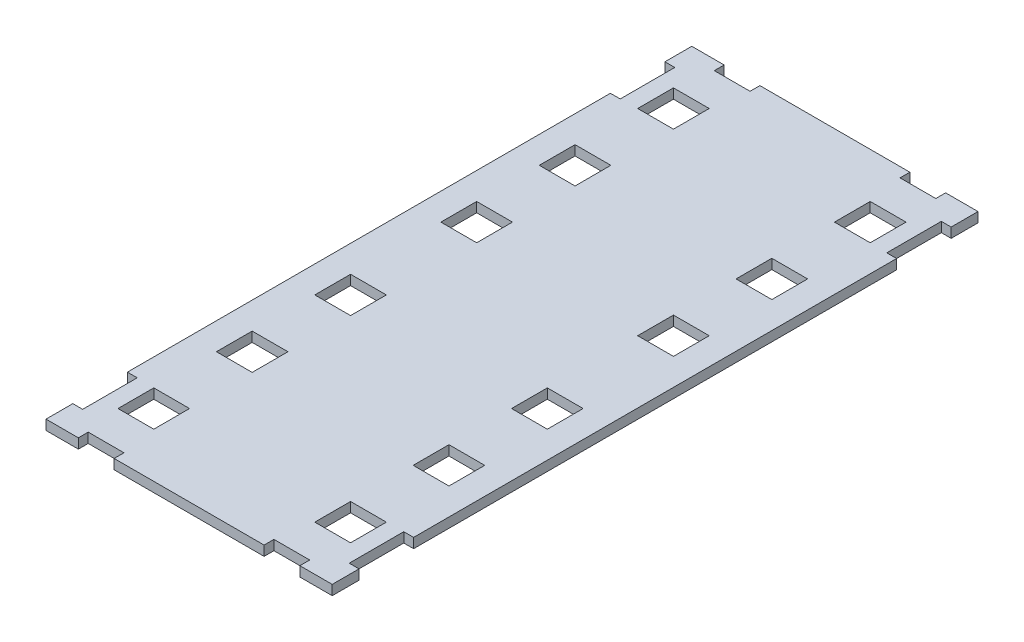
ISO-10303-21;
HEADER;
FILE_DESCRIPTION(('STEP AP214'),'2;1');
FILE_NAME('part.step','',(''),(''),'','','');
FILE_SCHEMA(('AUTOMOTIVE_DESIGN { 1 0 10303 214 1 1 1 1 }'));
ENDSEC;
DATA;
#1=APPLICATION_CONTEXT('core data for automotive mechanical design processes');
#2=APPLICATION_PROTOCOL_DEFINITION('international standard','automotive_design',2000,#1);
#3=PRODUCT_CONTEXT('',#1,'mechanical');
#4=PRODUCT('Part','Part','',(#3));
#5=PRODUCT_RELATED_PRODUCT_CATEGORY('part','',(#4));
#6=PRODUCT_DEFINITION_FORMATION('','',#4);
#7=PRODUCT_DEFINITION_CONTEXT('part definition',#1,'design');
#8=PRODUCT_DEFINITION('design','',#6,#7);
#9=PRODUCT_DEFINITION_SHAPE('','',#8);
#10=(LENGTH_UNIT() NAMED_UNIT(*) SI_UNIT(.MILLI.,.METRE.));
#11=(NAMED_UNIT(*) PLANE_ANGLE_UNIT() SI_UNIT($,.RADIAN.));
#12=(NAMED_UNIT(*) SI_UNIT($,.STERADIAN.) SOLID_ANGLE_UNIT());
#13=UNCERTAINTY_MEASURE_WITH_UNIT(LENGTH_MEASURE(1.E-05),#10,'distance_accuracy_value','');
#14=(GEOMETRIC_REPRESENTATION_CONTEXT(3) GLOBAL_UNCERTAINTY_ASSIGNED_CONTEXT((#13)) GLOBAL_UNIT_ASSIGNED_CONTEXT((#10,
#11,#12)) REPRESENTATION_CONTEXT('',''));
#15=CARTESIAN_POINT('',(0.,0.,0.));
#16=DIRECTION('',(0.,0.,1.));
#17=DIRECTION('',(1.,0.,0.));
#18=AXIS2_PLACEMENT_3D('',#15,#16,#17);
#19=CARTESIAN_POINT('',(0.,5.5,0.));
#20=DIRECTION('',(0.,1.,0.));
#21=DIRECTION('',(0.,0.,1.));
#22=AXIS2_PLACEMENT_3D('',#19,#20,#21);
#23=PLANE('',#22);
#24=DIRECTION('',(1.,0.,0.));
#25=VECTOR('',#24,1.);
#26=CARTESIAN_POINT('',(0.,5.5,-321.));
#27=LINE('',#26,#25);
#28=CARTESIAN_POINT('',(-41.9142802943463,5.5,-321.));
#29=VERTEX_POINT('',#28);
#30=CARTESIAN_POINT('',(41.9142802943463,5.5,-321.));
#31=VERTEX_POINT('',#30);
#32=EDGE_CURVE('E1425',#29,#31,#27,.T.);
#33=ORIENTED_EDGE('',*,*,#32,.F.);
#34=DIRECTION('',(0.,0.,-1.));
#35=VECTOR('',#34,1.);
#36=CARTESIAN_POINT('',(-41.9142802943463,5.5,0.));
#37=LINE('',#36,#35);
#38=CARTESIAN_POINT('',(-41.9142802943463,5.5,-315.5));
#39=VERTEX_POINT('',#38);
#40=EDGE_CURVE('E1198',#39,#29,#37,.T.);
#41=ORIENTED_EDGE('',*,*,#40,.F.);
#42=DIRECTION('',(1.,0.,0.));
#43=VECTOR('',#42,1.);
#44=CARTESIAN_POINT('',(0.,5.5,-315.5));
#45=LINE('',#44,#43);
#46=CARTESIAN_POINT('',(-61.9142802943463,5.5,-315.5));
#47=VERTEX_POINT('',#46);
#48=EDGE_CURVE('E1194',#47,#39,#45,.T.);
#49=ORIENTED_EDGE('',*,*,#48,.F.);
#50=DIRECTION('',(0.,0.,1.));
#51=VECTOR('',#50,1.);
#52=CARTESIAN_POINT('',(-61.9142802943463,5.5,0.));
#53=LINE('',#52,#51);
#54=CARTESIAN_POINT('',(-61.9142802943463,5.5,-321.));
#55=VERTEX_POINT('',#54);
#56=EDGE_CURVE('E1190',#55,#47,#53,.T.);
#57=ORIENTED_EDGE('',*,*,#56,.F.);
#58=DIRECTION('',(-1.,0.,0.));
#59=VECTOR('',#58,1.);
#60=CARTESIAN_POINT('',(0.,5.5,-321.));
#61=LINE('',#60,#59);
#62=CARTESIAN_POINT('',(-79.9999999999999,5.5,-321.));
#63=VERTEX_POINT('',#62);
#64=EDGE_CURVE('E1186',#55,#63,#61,.T.);
#65=ORIENTED_EDGE('',*,*,#64,.T.);
#66=DIRECTION('',(0.,0.,-1.));
#67=VECTOR('',#66,1.);
#68=CARTESIAN_POINT('',(-79.9999999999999,5.5,0.));
#69=LINE('',#68,#67);
#70=CARTESIAN_POINT('',(-79.9999999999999,5.5,-306.));
#71=VERTEX_POINT('',#70);
#72=EDGE_CURVE('E1182',#71,#63,#69,.T.);
#73=ORIENTED_EDGE('',*,*,#72,.F.);
#74=DIRECTION('',(1.,0.,0.));
#75=VECTOR('',#74,1.);
#76=CARTESIAN_POINT('',(0.,5.5,-306.));
#77=LINE('',#76,#75);
#78=CARTESIAN_POINT('',(-74.4999999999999,5.5,-306.));
#79=VERTEX_POINT('',#78);
#80=EDGE_CURVE('E1178',#71,#79,#77,.T.);
#81=ORIENTED_EDGE('',*,*,#80,.T.);
#82=DIRECTION('',(0.,0.,1.));
#83=VECTOR('',#82,1.);
#84=CARTESIAN_POINT('',(-74.4999999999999,5.5,0.));
#85=LINE('',#84,#83);
#86=CARTESIAN_POINT('',(-74.4999999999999,5.5,-275.5));
#87=VERTEX_POINT('',#86);
#88=EDGE_CURVE('E1174',#79,#87,#85,.T.);
#89=ORIENTED_EDGE('',*,*,#88,.T.);
#90=DIRECTION('',(-1.,0.,0.));
#91=VECTOR('',#90,1.);
#92=CARTESIAN_POINT('',(0.,5.5,-275.5));
#93=LINE('',#92,#91);
#94=CARTESIAN_POINT('',(-79.9999999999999,5.5,-275.5));
#95=VERTEX_POINT('',#94);
#96=EDGE_CURVE('E1169',#87,#95,#93,.T.);
#97=ORIENTED_EDGE('',*,*,#96,.T.);
#98=DIRECTION('',(0.,0.,-1.));
#99=VECTOR('',#98,1.);
#100=CARTESIAN_POINT('',(-80.0000000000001,5.5,0.));
#101=LINE('',#100,#99);
#102=CARTESIAN_POINT('',(-79.9999999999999,5.5,-5.50000000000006));
#103=VERTEX_POINT('',#102);
#104=EDGE_CURVE('E1165',#103,#95,#101,.T.);
#105=ORIENTED_EDGE('',*,*,#104,.F.);
#106=DIRECTION('',(-1.,0.,0.));
#107=VECTOR('',#106,1.);
#108=CARTESIAN_POINT('',(0.,5.5,-5.50000000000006));
#109=LINE('',#108,#107);
#110=CARTESIAN_POINT('',(-74.4999999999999,5.5,-5.50000000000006));
#111=VERTEX_POINT('',#110);
#112=EDGE_CURVE('E709',#111,#103,#109,.T.);
#113=ORIENTED_EDGE('',*,*,#112,.F.);
#114=DIRECTION('',(0.,0.,-1.));
#115=VECTOR('',#114,1.);
#116=CARTESIAN_POINT('',(-74.4999999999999,5.5,-281.));
#117=LINE('',#116,#115);
#118=CARTESIAN_POINT('',(-74.4999999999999,5.5,25.));
#119=VERTEX_POINT('',#118);
#120=EDGE_CURVE('E713',#119,#111,#117,.T.);
#121=ORIENTED_EDGE('',*,*,#120,.F.);
#122=DIRECTION('',(1.,0.,0.));
#123=VECTOR('',#122,1.);
#124=CARTESIAN_POINT('',(0.,5.5,25.));
#125=LINE('',#124,#123);
#126=CARTESIAN_POINT('',(-79.9999999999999,5.5,25.));
#127=VERTEX_POINT('',#126);
#128=EDGE_CURVE('E718',#127,#119,#125,.T.);
#129=ORIENTED_EDGE('',*,*,#128,.F.);
#130=DIRECTION('',(0.,0.,1.));
#131=VECTOR('',#130,1.);
#132=CARTESIAN_POINT('',(-79.9999999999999,5.5,-281.));
#133=LINE('',#132,#131);
#134=CARTESIAN_POINT('',(-79.9999999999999,5.5,40.));
#135=VERTEX_POINT('',#134);
#136=EDGE_CURVE('E722',#127,#135,#133,.T.);
#137=ORIENTED_EDGE('',*,*,#136,.T.);
#138=DIRECTION('',(-1.,0.,0.));
#139=VECTOR('',#138,1.);
#140=CARTESIAN_POINT('',(0.,5.5,40.));
#141=LINE('',#140,#139);
#142=CARTESIAN_POINT('',(-61.9142802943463,5.5,40.));
#143=VERTEX_POINT('',#142);
#144=EDGE_CURVE('E726',#143,#135,#141,.T.);
#145=ORIENTED_EDGE('',*,*,#144,.F.);
#146=DIRECTION('',(0.,0.,-1.));
#147=VECTOR('',#146,1.);
#148=CARTESIAN_POINT('',(-61.9142802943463,5.5,-281.));
#149=LINE('',#148,#147);
#150=CARTESIAN_POINT('',(-61.9142802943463,5.5,34.5));
#151=VERTEX_POINT('',#150);
#152=EDGE_CURVE('E730',#143,#151,#149,.T.);
#153=ORIENTED_EDGE('',*,*,#152,.T.);
#154=DIRECTION('',(1.,0.,0.));
#155=VECTOR('',#154,1.);
#156=CARTESIAN_POINT('',(0.,5.5,34.5));
#157=LINE('',#156,#155);
#158=CARTESIAN_POINT('',(-41.9142802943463,5.5,34.5));
#159=VERTEX_POINT('',#158);
#160=EDGE_CURVE('E734',#151,#159,#157,.T.);
#161=ORIENTED_EDGE('',*,*,#160,.T.);
#162=DIRECTION('',(0.,0.,1.));
#163=VECTOR('',#162,1.);
#164=CARTESIAN_POINT('',(-41.9142802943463,5.5,-281.));
#165=LINE('',#164,#163);
#166=CARTESIAN_POINT('',(-41.9142802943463,5.5,40.));
#167=VERTEX_POINT('',#166);
#168=EDGE_CURVE('E738',#159,#167,#165,.T.);
#169=ORIENTED_EDGE('',*,*,#168,.T.);
#170=DIRECTION('',(1.,0.,0.));
#171=VECTOR('',#170,1.);
#172=CARTESIAN_POINT('',(0.,5.5,40.));
#173=LINE('',#172,#171);
#174=CARTESIAN_POINT('',(41.9142802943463,5.5,40.));
#175=VERTEX_POINT('',#174);
#176=EDGE_CURVE('E966',#167,#175,#173,.T.);
#177=ORIENTED_EDGE('',*,*,#176,.T.);
#178=DIRECTION('',(0.,0.,1.));
#179=VECTOR('',#178,1.);
#180=CARTESIAN_POINT('',(41.9142802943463,5.5,-281.));
#181=LINE('',#180,#179);
#182=CARTESIAN_POINT('',(41.9142802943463,5.5,34.5));
#183=VERTEX_POINT('',#182);
#184=EDGE_CURVE('E962',#183,#175,#181,.T.);
#185=ORIENTED_EDGE('',*,*,#184,.F.);
#186=DIRECTION('',(-1.,0.,0.));
#187=VECTOR('',#186,1.);
#188=CARTESIAN_POINT('',(0.,5.5,34.5));
#189=LINE('',#188,#187);
#190=CARTESIAN_POINT('',(61.9142802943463,5.5,34.5));
#191=VERTEX_POINT('',#190);
#192=EDGE_CURVE('E958',#191,#183,#189,.T.);
#193=ORIENTED_EDGE('',*,*,#192,.F.);
#194=DIRECTION('',(0.,0.,-1.));
#195=VECTOR('',#194,1.);
#196=CARTESIAN_POINT('',(61.9142802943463,5.5,-281.));
#197=LINE('',#196,#195);
#198=CARTESIAN_POINT('',(61.9142802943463,5.5,40.));
#199=VERTEX_POINT('',#198);
#200=EDGE_CURVE('E954',#199,#191,#197,.T.);
#201=ORIENTED_EDGE('',*,*,#200,.F.);
#202=DIRECTION('',(1.,0.,0.));
#203=VECTOR('',#202,1.);
#204=CARTESIAN_POINT('',(0.,5.5,40.));
#205=LINE('',#204,#203);
#206=CARTESIAN_POINT('',(79.9999999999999,5.5,40.));
#207=VERTEX_POINT('',#206);
#208=EDGE_CURVE('E950',#199,#207,#205,.T.);
#209=ORIENTED_EDGE('',*,*,#208,.T.);
#210=DIRECTION('',(0.,0.,1.));
#211=VECTOR('',#210,1.);
#212=CARTESIAN_POINT('',(79.9999999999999,5.5,-281.));
#213=LINE('',#212,#211);
#214=CARTESIAN_POINT('',(79.9999999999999,5.5,25.));
#215=VERTEX_POINT('',#214);
#216=EDGE_CURVE('E946',#215,#207,#213,.T.);
#217=ORIENTED_EDGE('',*,*,#216,.F.);
#218=DIRECTION('',(-1.,0.,0.));
#219=VECTOR('',#218,1.);
#220=CARTESIAN_POINT('',(0.,5.5,25.));
#221=LINE('',#220,#219);
#222=CARTESIAN_POINT('',(74.4999999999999,5.5,25.));
#223=VERTEX_POINT('',#222);
#224=EDGE_CURVE('E942',#215,#223,#221,.T.);
#225=ORIENTED_EDGE('',*,*,#224,.T.);
#226=DIRECTION('',(0.,0.,-1.));
#227=VECTOR('',#226,1.);
#228=CARTESIAN_POINT('',(74.4999999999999,5.5,-281.));
#229=LINE('',#228,#227);
#230=CARTESIAN_POINT('',(74.4999999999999,5.5,-5.50000000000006));
#231=VERTEX_POINT('',#230);
#232=EDGE_CURVE('E937',#223,#231,#229,.T.);
#233=ORIENTED_EDGE('',*,*,#232,.T.);
#234=DIRECTION('',(1.,0.,0.));
#235=VECTOR('',#234,1.);
#236=CARTESIAN_POINT('',(0.,5.5,-5.50000000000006));
#237=LINE('',#236,#235);
#238=CARTESIAN_POINT('',(79.9999999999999,5.5,-5.50000000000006));
#239=VERTEX_POINT('',#238);
#240=EDGE_CURVE('E933',#231,#239,#237,.T.);
#241=ORIENTED_EDGE('',*,*,#240,.T.);
#242=DIRECTION('',(0.,0.,-1.));
#243=VECTOR('',#242,1.);
#244=CARTESIAN_POINT('',(80.0000000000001,5.5,0.));
#245=LINE('',#244,#243);
#246=CARTESIAN_POINT('',(79.9999999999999,5.5,-275.5));
#247=VERTEX_POINT('',#246);
#248=EDGE_CURVE('E1393',#239,#247,#245,.T.);
#249=ORIENTED_EDGE('',*,*,#248,.T.);
#250=DIRECTION('',(1.,0.,0.));
#251=VECTOR('',#250,1.);
#252=CARTESIAN_POINT('',(0.,5.5,-275.5));
#253=LINE('',#252,#251);
#254=CARTESIAN_POINT('',(74.4999999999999,5.5,-275.5));
#255=VERTEX_POINT('',#254);
#256=EDGE_CURVE('E1396',#255,#247,#253,.T.);
#257=ORIENTED_EDGE('',*,*,#256,.F.);
#258=DIRECTION('',(0.,0.,1.));
#259=VECTOR('',#258,1.);
#260=CARTESIAN_POINT('',(74.4999999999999,5.5,0.));
#261=LINE('',#260,#259);
#262=CARTESIAN_POINT('',(74.4999999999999,5.5,-306.));
#263=VERTEX_POINT('',#262);
#264=EDGE_CURVE('E1401',#263,#255,#261,.T.);
#265=ORIENTED_EDGE('',*,*,#264,.F.);
#266=DIRECTION('',(-1.,0.,0.));
#267=VECTOR('',#266,1.);
#268=CARTESIAN_POINT('',(0.,5.5,-306.));
#269=LINE('',#268,#267);
#270=CARTESIAN_POINT('',(79.9999999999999,5.5,-306.));
#271=VERTEX_POINT('',#270);
#272=EDGE_CURVE('E1405',#271,#263,#269,.T.);
#273=ORIENTED_EDGE('',*,*,#272,.F.);
#274=DIRECTION('',(0.,0.,-1.));
#275=VECTOR('',#274,1.);
#276=CARTESIAN_POINT('',(79.9999999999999,5.5,0.));
#277=LINE('',#276,#275);
#278=CARTESIAN_POINT('',(79.9999999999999,5.5,-321.));
#279=VERTEX_POINT('',#278);
#280=EDGE_CURVE('E1409',#271,#279,#277,.T.);
#281=ORIENTED_EDGE('',*,*,#280,.T.);
#282=DIRECTION('',(1.,0.,0.));
#283=VECTOR('',#282,1.);
#284=CARTESIAN_POINT('',(0.,5.5,-321.));
#285=LINE('',#284,#283);
#286=CARTESIAN_POINT('',(61.9142802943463,5.5,-321.));
#287=VERTEX_POINT('',#286);
#288=EDGE_CURVE('E1412',#287,#279,#285,.T.);
#289=ORIENTED_EDGE('',*,*,#288,.F.);
#290=DIRECTION('',(0.,0.,1.));
#291=VECTOR('',#290,1.);
#292=CARTESIAN_POINT('',(61.9142802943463,5.5,0.));
#293=LINE('',#292,#291);
#294=CARTESIAN_POINT('',(61.9142802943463,5.5,-315.5));
#295=VERTEX_POINT('',#294);
#296=EDGE_CURVE('E1416',#287,#295,#293,.T.);
#297=ORIENTED_EDGE('',*,*,#296,.T.);
#298=DIRECTION('',(-1.,0.,0.));
#299=VECTOR('',#298,1.);
#300=CARTESIAN_POINT('',(0.,5.5,-315.5));
#301=LINE('',#300,#299);
#302=CARTESIAN_POINT('',(41.9142802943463,5.5,-315.5));
#303=VERTEX_POINT('',#302);
#304=EDGE_CURVE('E1419',#295,#303,#301,.T.);
#305=ORIENTED_EDGE('',*,*,#304,.T.);
#306=DIRECTION('',(0.,0.,-1.));
#307=VECTOR('',#306,1.);
#308=CARTESIAN_POINT('',(41.9142802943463,5.5,0.));
#309=LINE('',#308,#307);
#310=EDGE_CURVE('E1422',#303,#31,#309,.T.);
#311=ORIENTED_EDGE('',*,*,#310,.T.);
#312=EDGE_LOOP('',(#33,#41,#49,#57,#65,#73,#81,#89,#97,#105,#113,#121,#129,#137,#145,#153,#161,
#169,#177,#185,#193,#201,#209,#217,#225,#233,#241,#249,#257,#265,#273,#281,#289,#297,#305,#311));
#313=FACE_BOUND('',#312,.T.);
#314=DIRECTION('',(0.,0.,1.));
#315=VECTOR('',#314,1.);
#316=CARTESIAN_POINT('',(45.,5.5,0.));
#317=LINE('',#316,#315);
#318=CARTESIAN_POINT('',(45.,5.5,-185.75));
#319=VERTEX_POINT('',#318);
#320=CARTESIAN_POINT('',(45.,5.5,-165.75));
#321=VERTEX_POINT('',#320);
#322=EDGE_CURVE('E1357',#319,#321,#317,.T.);
#323=ORIENTED_EDGE('',*,*,#322,.F.);
#324=DIRECTION('',(1.,0.,0.));
#325=VECTOR('',#324,1.);
#326=CARTESIAN_POINT('',(0.,5.5,-185.75));
#327=LINE('',#326,#325);
#328=CARTESIAN_POINT('',(65.,5.5,-185.75));
#329=VERTEX_POINT('',#328);
#330=EDGE_CURVE('E1360',#319,#329,#327,.T.);
#331=ORIENTED_EDGE('',*,*,#330,.T.);
#332=DIRECTION('',(0.,0.,1.));
#333=VECTOR('',#332,1.);
#334=CARTESIAN_POINT('',(65.,5.5,0.));
#335=LINE('',#334,#333);
#336=CARTESIAN_POINT('',(65.,5.5,-165.75));
#337=VERTEX_POINT('',#336);
#338=EDGE_CURVE('E1294',#329,#337,#335,.T.);
#339=ORIENTED_EDGE('',*,*,#338,.T.);
#340=DIRECTION('',(1.,0.,0.));
#341=VECTOR('',#340,1.);
#342=CARTESIAN_POINT('',(-2.30024332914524E-13,5.5,-165.75));
#343=LINE('',#342,#341);
#344=EDGE_CURVE('E1353',#321,#337,#343,.T.);
#345=ORIENTED_EDGE('',*,*,#344,.F.);
#346=EDGE_LOOP('',(#323,#331,#339,#345));
#347=FACE_BOUND('',#346,.T.);
#348=DIRECTION('',(0.,0.,1.));
#349=VECTOR('',#348,1.);
#350=CARTESIAN_POINT('',(44.9999999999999,5.5,0.));
#351=LINE('',#350,#349);
#352=CARTESIAN_POINT('',(44.9999999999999,5.5,-240.75));
#353=VERTEX_POINT('',#352);
#354=CARTESIAN_POINT('',(44.9999999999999,5.5,-220.75));
#355=VERTEX_POINT('',#354);
#356=EDGE_CURVE('E1371',#353,#355,#351,.T.);
#357=ORIENTED_EDGE('',*,*,#356,.F.);
#358=DIRECTION('',(1.,0.,0.));
#359=VECTOR('',#358,1.);
#360=CARTESIAN_POINT('',(0.,5.5,-240.75));
#361=LINE('',#360,#359);
#362=CARTESIAN_POINT('',(64.9999999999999,5.5,-240.75));
#363=VERTEX_POINT('',#362);
#364=EDGE_CURVE('E1374',#353,#363,#361,.T.);
#365=ORIENTED_EDGE('',*,*,#364,.T.);
#366=DIRECTION('',(0.,0.,1.));
#367=VECTOR('',#366,1.);
#368=CARTESIAN_POINT('',(64.9999999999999,5.5,0.));
#369=LINE('',#368,#367);
#370=CARTESIAN_POINT('',(64.9999999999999,5.5,-220.75));
#371=VERTEX_POINT('',#370);
#372=EDGE_CURVE('E1364',#363,#371,#369,.T.);
#373=ORIENTED_EDGE('',*,*,#372,.T.);
#374=DIRECTION('',(1.,0.,0.));
#375=VECTOR('',#374,1.);
#376=CARTESIAN_POINT('',(0.,5.5,-220.75));
#377=LINE('',#376,#375);
#378=EDGE_CURVE('E1368',#355,#371,#377,.T.);
#379=ORIENTED_EDGE('',*,*,#378,.F.);
#380=EDGE_LOOP('',(#357,#365,#373,#379));
#381=FACE_BOUND('',#380,.T.);
#382=DIRECTION('',(0.,0.,1.));
#383=VECTOR('',#382,1.);
#384=CARTESIAN_POINT('',(44.9999999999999,5.5,0.));
#385=LINE('',#384,#383);
#386=CARTESIAN_POINT('',(44.9999999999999,5.5,-295.75));
#387=VERTEX_POINT('',#386);
#388=CARTESIAN_POINT('',(44.9999999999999,5.5,-275.75));
#389=VERTEX_POINT('',#388);
#390=EDGE_CURVE('E1385',#387,#389,#385,.T.);
#391=ORIENTED_EDGE('',*,*,#390,.F.);
#392=DIRECTION('',(1.,0.,0.));
#393=VECTOR('',#392,1.);
#394=CARTESIAN_POINT('',(0.,5.5,-295.75));
#395=LINE('',#394,#393);
#396=CARTESIAN_POINT('',(64.9999999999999,5.5,-295.75));
#397=VERTEX_POINT('',#396);
#398=EDGE_CURVE('E1388',#387,#397,#395,.T.);
#399=ORIENTED_EDGE('',*,*,#398,.T.);
#400=DIRECTION('',(0.,0.,1.));
#401=VECTOR('',#400,1.);
#402=CARTESIAN_POINT('',(64.9999999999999,5.5,0.));
#403=LINE('',#402,#401);
#404=CARTESIAN_POINT('',(64.9999999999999,5.5,-275.75));
#405=VERTEX_POINT('',#404);
#406=EDGE_CURVE('E1378',#397,#405,#403,.T.);
#407=ORIENTED_EDGE('',*,*,#406,.T.);
#408=DIRECTION('',(1.,0.,0.));
#409=VECTOR('',#408,1.);
#410=CARTESIAN_POINT('',(0.,5.5,-275.75));
#411=LINE('',#410,#409);
#412=EDGE_CURVE('E1382',#389,#405,#411,.T.);
#413=ORIENTED_EDGE('',*,*,#412,.F.);
#414=EDGE_LOOP('',(#391,#399,#407,#413));
#415=FACE_BOUND('',#414,.T.);
#416=DIRECTION('',(0.,0.,1.));
#417=VECTOR('',#416,1.);
#418=CARTESIAN_POINT('',(-45.,5.5,0.));
#419=LINE('',#418,#417);
#420=CARTESIAN_POINT('',(-45.,5.5,-185.75));
#421=VERTEX_POINT('',#420);
#422=CARTESIAN_POINT('',(-45.,5.5,-165.75));
#423=VERTEX_POINT('',#422);
#424=EDGE_CURVE('E1124',#421,#423,#419,.T.);
#425=ORIENTED_EDGE('',*,*,#424,.T.);
#426=DIRECTION('',(-1.,0.,0.));
#427=VECTOR('',#426,1.);
#428=CARTESIAN_POINT('',(2.30024332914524E-13,5.5,-165.75));
#429=LINE('',#428,#427);
#430=CARTESIAN_POINT('',(-65.,5.5,-165.75));
#431=VERTEX_POINT('',#430);
#432=EDGE_CURVE('E1120',#423,#431,#429,.T.);
#433=ORIENTED_EDGE('',*,*,#432,.T.);
#434=DIRECTION('',(0.,0.,1.));
#435=VECTOR('',#434,1.);
#436=CARTESIAN_POINT('',(-65.,5.5,0.));
#437=LINE('',#436,#435);
#438=CARTESIAN_POINT('',(-65.,5.5,-185.75));
#439=VERTEX_POINT('',#438);
#440=EDGE_CURVE('E1062',#439,#431,#437,.T.);
#441=ORIENTED_EDGE('',*,*,#440,.F.);
#442=DIRECTION('',(-1.,0.,0.));
#443=VECTOR('',#442,1.);
#444=CARTESIAN_POINT('',(0.,5.5,-185.75));
#445=LINE('',#444,#443);
#446=EDGE_CURVE('E1128',#421,#439,#445,.T.);
#447=ORIENTED_EDGE('',*,*,#446,.F.);
#448=EDGE_LOOP('',(#425,#433,#441,#447));
#449=FACE_BOUND('',#448,.T.);
#450=DIRECTION('',(0.,0.,1.));
#451=VECTOR('',#450,1.);
#452=CARTESIAN_POINT('',(-44.9999999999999,5.5,0.));
#453=LINE('',#452,#451);
#454=CARTESIAN_POINT('',(-44.9999999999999,5.5,-240.75));
#455=VERTEX_POINT('',#454);
#456=CARTESIAN_POINT('',(-44.9999999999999,5.5,-220.75));
#457=VERTEX_POINT('',#456);
#458=EDGE_CURVE('E1140',#455,#457,#453,.T.);
#459=ORIENTED_EDGE('',*,*,#458,.T.);
#460=DIRECTION('',(-1.,0.,0.));
#461=VECTOR('',#460,1.);
#462=CARTESIAN_POINT('',(0.,5.5,-220.75));
#463=LINE('',#462,#461);
#464=CARTESIAN_POINT('',(-64.9999999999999,5.5,-220.75));
#465=VERTEX_POINT('',#464);
#466=EDGE_CURVE('E1136',#457,#465,#463,.T.);
#467=ORIENTED_EDGE('',*,*,#466,.T.);
#468=DIRECTION('',(0.,0.,1.));
#469=VECTOR('',#468,1.);
#470=CARTESIAN_POINT('',(-64.9999999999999,5.5,0.));
#471=LINE('',#470,#469);
#472=CARTESIAN_POINT('',(-64.9999999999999,5.5,-240.75));
#473=VERTEX_POINT('',#472);
#474=EDGE_CURVE('E1132',#473,#465,#471,.T.);
#475=ORIENTED_EDGE('',*,*,#474,.F.);
#476=DIRECTION('',(-1.,0.,0.));
#477=VECTOR('',#476,1.);
#478=CARTESIAN_POINT('',(0.,5.5,-240.75));
#479=LINE('',#478,#477);
#480=EDGE_CURVE('E1144',#455,#473,#479,.T.);
#481=ORIENTED_EDGE('',*,*,#480,.F.);
#482=EDGE_LOOP('',(#459,#467,#475,#481));
#483=FACE_BOUND('',#482,.T.);
#484=DIRECTION('',(0.,0.,1.));
#485=VECTOR('',#484,1.);
#486=CARTESIAN_POINT('',(-44.9999999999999,5.5,0.));
#487=LINE('',#486,#485);
#488=CARTESIAN_POINT('',(-44.9999999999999,5.5,-295.75));
#489=VERTEX_POINT('',#488);
#490=CARTESIAN_POINT('',(-44.9999999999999,5.5,-275.75));
#491=VERTEX_POINT('',#490);
#492=EDGE_CURVE('E1156',#489,#491,#487,.T.);
#493=ORIENTED_EDGE('',*,*,#492,.T.);
#494=DIRECTION('',(-1.,0.,0.));
#495=VECTOR('',#494,1.);
#496=CARTESIAN_POINT('',(0.,5.5,-275.75));
#497=LINE('',#496,#495);
#498=CARTESIAN_POINT('',(-64.9999999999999,5.5,-275.75));
#499=VERTEX_POINT('',#498);
#500=EDGE_CURVE('E1152',#491,#499,#497,.T.);
#501=ORIENTED_EDGE('',*,*,#500,.T.);
#502=DIRECTION('',(0.,0.,1.));
#503=VECTOR('',#502,1.);
#504=CARTESIAN_POINT('',(-64.9999999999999,5.5,0.));
#505=LINE('',#504,#503);
#506=CARTESIAN_POINT('',(-64.9999999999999,5.5,-295.75));
#507=VERTEX_POINT('',#506);
#508=EDGE_CURVE('E1148',#507,#499,#505,.T.);
#509=ORIENTED_EDGE('',*,*,#508,.F.);
#510=DIRECTION('',(-1.,0.,0.));
#511=VECTOR('',#510,1.);
#512=CARTESIAN_POINT('',(0.,5.5,-295.75));
#513=LINE('',#512,#511);
#514=EDGE_CURVE('E1160',#489,#507,#513,.T.);
#515=ORIENTED_EDGE('',*,*,#514,.F.);
#516=EDGE_LOOP('',(#493,#501,#509,#515));
#517=FACE_BOUND('',#516,.T.);
#518=DIRECTION('',(0.,0.,-1.));
#519=VECTOR('',#518,1.);
#520=CARTESIAN_POINT('',(45.,5.5,-281.));
#521=LINE('',#520,#519);
#522=CARTESIAN_POINT('',(45.,5.5,-95.2500000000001));
#523=VERTEX_POINT('',#522);
#524=CARTESIAN_POINT('',(45.,5.5,-115.25));
#525=VERTEX_POINT('',#524);
#526=EDGE_CURVE('E892',#523,#525,#521,.T.);
#527=ORIENTED_EDGE('',*,*,#526,.T.);
#528=DIRECTION('',(1.,0.,0.));
#529=VECTOR('',#528,1.);
#530=CARTESIAN_POINT('',(-2.30024332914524E-13,5.5,-115.25));
#531=LINE('',#530,#529);
#532=CARTESIAN_POINT('',(65.,5.5,-115.25));
#533=VERTEX_POINT('',#532);
#534=EDGE_CURVE('E888',#525,#533,#531,.T.);
#535=ORIENTED_EDGE('',*,*,#534,.T.);
#536=DIRECTION('',(0.,0.,-1.));
#537=VECTOR('',#536,1.);
#538=CARTESIAN_POINT('',(65.,5.5,-281.));
#539=LINE('',#538,#537);
#540=CARTESIAN_POINT('',(65.,5.5,-95.2500000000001));
#541=VERTEX_POINT('',#540);
#542=EDGE_CURVE('E830',#541,#533,#539,.T.);
#543=ORIENTED_EDGE('',*,*,#542,.F.);
#544=DIRECTION('',(1.,0.,0.));
#545=VECTOR('',#544,1.);
#546=CARTESIAN_POINT('',(0.,5.5,-95.2500000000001));
#547=LINE('',#546,#545);
#548=EDGE_CURVE('E896',#523,#541,#547,.T.);
#549=ORIENTED_EDGE('',*,*,#548,.F.);
#550=EDGE_LOOP('',(#527,#535,#543,#549));
#551=FACE_BOUND('',#550,.T.);
#552=DIRECTION('',(0.,0.,-1.));
#553=VECTOR('',#552,1.);
#554=CARTESIAN_POINT('',(44.9999999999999,5.5,-281.));
#555=LINE('',#554,#553);
#556=CARTESIAN_POINT('',(44.9999999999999,5.5,-40.25));
#557=VERTEX_POINT('',#556);
#558=CARTESIAN_POINT('',(44.9999999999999,5.5,-60.25));
#559=VERTEX_POINT('',#558);
#560=EDGE_CURVE('E908',#557,#559,#555,.T.);
#561=ORIENTED_EDGE('',*,*,#560,.T.);
#562=DIRECTION('',(1.,0.,0.));
#563=VECTOR('',#562,1.);
#564=CARTESIAN_POINT('',(0.,5.5,-60.25));
#565=LINE('',#564,#563);
#566=CARTESIAN_POINT('',(64.9999999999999,5.5,-60.25));
#567=VERTEX_POINT('',#566);
#568=EDGE_CURVE('E904',#559,#567,#565,.T.);
#569=ORIENTED_EDGE('',*,*,#568,.T.);
#570=DIRECTION('',(0.,0.,-1.));
#571=VECTOR('',#570,1.);
#572=CARTESIAN_POINT('',(64.9999999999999,5.5,-281.));
#573=LINE('',#572,#571);
#574=CARTESIAN_POINT('',(64.9999999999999,5.5,-40.25));
#575=VERTEX_POINT('',#574);
#576=EDGE_CURVE('E900',#575,#567,#573,.T.);
#577=ORIENTED_EDGE('',*,*,#576,.F.);
#578=DIRECTION('',(1.,0.,0.));
#579=VECTOR('',#578,1.);
#580=CARTESIAN_POINT('',(0.,5.5,-40.25));
#581=LINE('',#580,#579);
#582=EDGE_CURVE('E912',#557,#575,#581,.T.);
#583=ORIENTED_EDGE('',*,*,#582,.F.);
#584=EDGE_LOOP('',(#561,#569,#577,#583));
#585=FACE_BOUND('',#584,.T.);
#586=DIRECTION('',(0.,0.,-1.));
#587=VECTOR('',#586,1.);
#588=CARTESIAN_POINT('',(44.9999999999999,5.5,-281.));
#589=LINE('',#588,#587);
#590=CARTESIAN_POINT('',(44.9999999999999,5.5,14.75));
#591=VERTEX_POINT('',#590);
#592=CARTESIAN_POINT('',(44.9999999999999,5.5,-5.25000000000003));
#593=VERTEX_POINT('',#592);
#594=EDGE_CURVE('E924',#591,#593,#589,.T.);
#595=ORIENTED_EDGE('',*,*,#594,.T.);
#596=DIRECTION('',(1.,0.,0.));
#597=VECTOR('',#596,1.);
#598=CARTESIAN_POINT('',(0.,5.5,-5.25000000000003));
#599=LINE('',#598,#597);
#600=CARTESIAN_POINT('',(64.9999999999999,5.5,-5.25000000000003));
#601=VERTEX_POINT('',#600);
#602=EDGE_CURVE('E920',#593,#601,#599,.T.);
#603=ORIENTED_EDGE('',*,*,#602,.T.);
#604=DIRECTION('',(0.,0.,-1.));
#605=VECTOR('',#604,1.);
#606=CARTESIAN_POINT('',(64.9999999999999,5.5,-281.));
#607=LINE('',#606,#605);
#608=CARTESIAN_POINT('',(64.9999999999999,5.5,14.75));
#609=VERTEX_POINT('',#608);
#610=EDGE_CURVE('E916',#609,#601,#607,.T.);
#611=ORIENTED_EDGE('',*,*,#610,.F.);
#612=DIRECTION('',(1.,0.,0.));
#613=VECTOR('',#612,1.);
#614=CARTESIAN_POINT('',(0.,5.5,14.75));
#615=LINE('',#614,#613);
#616=EDGE_CURVE('E928',#591,#609,#615,.T.);
#617=ORIENTED_EDGE('',*,*,#616,.F.);
#618=EDGE_LOOP('',(#595,#603,#611,#617));
#619=FACE_BOUND('',#618,.T.);
#620=DIRECTION('',(0.,0.,-1.));
#621=VECTOR('',#620,1.);
#622=CARTESIAN_POINT('',(-45.,5.5,-281.));
#623=LINE('',#622,#621);
#624=CARTESIAN_POINT('',(-45.,5.5,-95.2500000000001));
#625=VERTEX_POINT('',#624);
#626=CARTESIAN_POINT('',(-45.,5.5,-115.25));
#627=VERTEX_POINT('',#626);
#628=EDGE_CURVE('E671',#625,#627,#623,.T.);
#629=ORIENTED_EDGE('',*,*,#628,.F.);
#630=DIRECTION('',(-1.,0.,0.));
#631=VECTOR('',#630,1.);
#632=CARTESIAN_POINT('',(0.,5.5,-95.2500000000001));
#633=LINE('',#632,#631);
#634=CARTESIAN_POINT('',(-65.,5.5,-95.2500000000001));
#635=VERTEX_POINT('',#634);
#636=EDGE_CURVE('E675',#625,#635,#633,.T.);
#637=ORIENTED_EDGE('',*,*,#636,.T.);
#638=DIRECTION('',(0.,0.,-1.));
#639=VECTOR('',#638,1.);
#640=CARTESIAN_POINT('',(-65.,5.5,-281.));
#641=LINE('',#640,#639);
#642=CARTESIAN_POINT('',(-65.,5.5,-115.25));
#643=VERTEX_POINT('',#642);
#644=EDGE_CURVE('E577',#635,#643,#641,.T.);
#645=ORIENTED_EDGE('',*,*,#644,.T.);
#646=DIRECTION('',(-1.,0.,0.));
#647=VECTOR('',#646,1.);
#648=CARTESIAN_POINT('',(2.30024332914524E-13,5.5,-115.25));
#649=LINE('',#648,#647);
#650=EDGE_CURVE('E667',#627,#643,#649,.T.);
#651=ORIENTED_EDGE('',*,*,#650,.F.);
#652=EDGE_LOOP('',(#629,#637,#645,#651));
#653=FACE_BOUND('',#652,.T.);
#654=DIRECTION('',(0.,0.,-1.));
#655=VECTOR('',#654,1.);
#656=CARTESIAN_POINT('',(-44.9999999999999,5.5,-281.));
#657=LINE('',#656,#655);
#658=CARTESIAN_POINT('',(-44.9999999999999,5.5,-40.25));
#659=VERTEX_POINT('',#658);
#660=CARTESIAN_POINT('',(-44.9999999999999,5.5,-60.25));
#661=VERTEX_POINT('',#660);
#662=EDGE_CURVE('E687',#659,#661,#657,.T.);
#663=ORIENTED_EDGE('',*,*,#662,.F.);
#664=DIRECTION('',(-1.,0.,0.));
#665=VECTOR('',#664,1.);
#666=CARTESIAN_POINT('',(0.,5.5,-40.25));
#667=LINE('',#666,#665);
#668=CARTESIAN_POINT('',(-64.9999999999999,5.5,-40.25));
#669=VERTEX_POINT('',#668);
#670=EDGE_CURVE('E691',#659,#669,#667,.T.);
#671=ORIENTED_EDGE('',*,*,#670,.T.);
#672=DIRECTION('',(0.,0.,-1.));
#673=VECTOR('',#672,1.);
#674=CARTESIAN_POINT('',(-64.9999999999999,5.5,-281.));
#675=LINE('',#674,#673);
#676=CARTESIAN_POINT('',(-64.9999999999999,5.5,-60.25));
#677=VERTEX_POINT('',#676);
#678=EDGE_CURVE('E679',#669,#677,#675,.T.);
#679=ORIENTED_EDGE('',*,*,#678,.T.);
#680=DIRECTION('',(-1.,0.,0.));
#681=VECTOR('',#680,1.);
#682=CARTESIAN_POINT('',(0.,5.5,-60.25));
#683=LINE('',#682,#681);
#684=EDGE_CURVE('E683',#661,#677,#683,.T.);
#685=ORIENTED_EDGE('',*,*,#684,.F.);
#686=EDGE_LOOP('',(#663,#671,#679,#685));
#687=FACE_BOUND('',#686,.T.);
#688=DIRECTION('',(0.,0.,-1.));
#689=VECTOR('',#688,1.);
#690=CARTESIAN_POINT('',(-44.9999999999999,5.5,-281.));
#691=LINE('',#690,#689);
#692=CARTESIAN_POINT('',(-44.9999999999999,5.5,14.75));
#693=VERTEX_POINT('',#692);
#694=CARTESIAN_POINT('',(-44.9999999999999,5.5,-5.25000000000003));
#695=VERTEX_POINT('',#694);
#696=EDGE_CURVE('E703',#693,#695,#691,.T.);
#697=ORIENTED_EDGE('',*,*,#696,.F.);
#698=DIRECTION('',(-1.,0.,0.));
#699=VECTOR('',#698,1.);
#700=CARTESIAN_POINT('',(0.,5.5,14.75));
#701=LINE('',#700,#699);
#702=CARTESIAN_POINT('',(-64.9999999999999,5.5,14.75));
#703=VERTEX_POINT('',#702);
#704=EDGE_CURVE('E572',#693,#703,#701,.T.);
#705=ORIENTED_EDGE('',*,*,#704,.T.);
#706=DIRECTION('',(0.,0.,-1.));
#707=VECTOR('',#706,1.);
#708=CARTESIAN_POINT('',(-64.9999999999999,5.5,-281.));
#709=LINE('',#708,#707);
#710=CARTESIAN_POINT('',(-64.9999999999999,5.5,-5.25000000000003));
#711=VERTEX_POINT('',#710);
#712=EDGE_CURVE('E695',#703,#711,#709,.T.);
#713=ORIENTED_EDGE('',*,*,#712,.T.);
#714=DIRECTION('',(-1.,0.,0.));
#715=VECTOR('',#714,1.);
#716=CARTESIAN_POINT('',(0.,5.5,-5.25000000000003));
#717=LINE('',#716,#715);
#718=EDGE_CURVE('E699',#695,#711,#717,.T.);
#719=ORIENTED_EDGE('',*,*,#718,.F.);
#720=EDGE_LOOP('',(#697,#705,#713,#719));
#721=FACE_BOUND('',#720,.T.);
#722=ADVANCED_FACE('F45',(#313,#347,#381,#415,#449,#483,#517,#551,#585,#619,#653,#687,#721),#23,.T.);
#723=CARTESIAN_POINT('',(0.,0.,0.));
#724=DIRECTION('',(0.,1.,0.));
#725=DIRECTION('',(0.,0.,1.));
#726=AXIS2_PLACEMENT_3D('',#723,#724,#725);
#727=PLANE('',#726);
#728=DIRECTION('',(-1.,0.,0.));
#729=VECTOR('',#728,1.);
#730=CARTESIAN_POINT('',(64.9999999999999,0.,-240.75));
#731=LINE('',#730,#729);
#732=CARTESIAN_POINT('',(64.9999999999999,0.,-240.75));
#733=VERTEX_POINT('',#732);
#734=CARTESIAN_POINT('',(44.9999999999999,0.,-240.75));
#735=VERTEX_POINT('',#734);
#736=EDGE_CURVE('E1270',#733,#735,#731,.T.);
#737=ORIENTED_EDGE('',*,*,#736,.T.);
#738=DIRECTION('',(0.,0.,-1.));
#739=VECTOR('',#738,1.);
#740=CARTESIAN_POINT('',(44.9999999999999,0.,-220.75));
#741=LINE('',#740,#739);
#742=CARTESIAN_POINT('',(44.9999999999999,0.,-220.75));
#743=VERTEX_POINT('',#742);
#744=EDGE_CURVE('E1316',#743,#735,#741,.T.);
#745=ORIENTED_EDGE('',*,*,#744,.F.);
#746=DIRECTION('',(-1.,0.,0.));
#747=VECTOR('',#746,1.);
#748=CARTESIAN_POINT('',(64.9999999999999,0.,-220.75));
#749=LINE('',#748,#747);
#750=CARTESIAN_POINT('',(64.9999999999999,0.,-220.75));
#751=VERTEX_POINT('',#750);
#752=EDGE_CURVE('E1312',#751,#743,#749,.T.);
#753=ORIENTED_EDGE('',*,*,#752,.F.);
#754=DIRECTION('',(0.,0.,-1.));
#755=VECTOR('',#754,1.);
#756=CARTESIAN_POINT('',(64.9999999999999,0.,-220.75));
#757=LINE('',#756,#755);
#758=EDGE_CURVE('E1308',#751,#733,#757,.T.);
#759=ORIENTED_EDGE('',*,*,#758,.T.);
#760=EDGE_LOOP('',(#737,#745,#753,#759));
#761=FACE_BOUND('',#760,.T.);
#762=DIRECTION('',(0.,0.,-1.));
#763=VECTOR('',#762,1.);
#764=CARTESIAN_POINT('',(80.0000000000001,0.,0.));
#765=LINE('',#764,#763);
#766=CARTESIAN_POINT('',(79.9999999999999,0.,-5.50000000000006));
#767=VERTEX_POINT('',#766);
#768=CARTESIAN_POINT('',(79.9999999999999,0.,-275.5));
#769=VERTEX_POINT('',#768);
#770=EDGE_CURVE('E1392',#767,#769,#765,.T.);
#771=ORIENTED_EDGE('',*,*,#770,.F.);
#772=DIRECTION('',(1.,0.,0.));
#773=VECTOR('',#772,1.);
#774=CARTESIAN_POINT('',(0.,0.,-5.50000000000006));
#775=LINE('',#774,#773);
#776=CARTESIAN_POINT('',(74.4999999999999,0.,-5.50000000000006));
#777=VERTEX_POINT('',#776);
#778=EDGE_CURVE('E932',#777,#767,#775,.T.);
#779=ORIENTED_EDGE('',*,*,#778,.F.);
#780=DIRECTION('',(0.,0.,-1.));
#781=VECTOR('',#780,1.);
#782=CARTESIAN_POINT('',(74.4999999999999,0.,-281.));
#783=LINE('',#782,#781);
#784=CARTESIAN_POINT('',(74.4999999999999,0.,25.));
#785=VERTEX_POINT('',#784);
#786=EDGE_CURVE('E974',#785,#777,#783,.T.);
#787=ORIENTED_EDGE('',*,*,#786,.F.);
#788=DIRECTION('',(-1.,0.,0.));
#789=VECTOR('',#788,1.);
#790=CARTESIAN_POINT('',(0.,0.,25.));
#791=LINE('',#790,#789);
#792=CARTESIAN_POINT('',(79.9999999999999,0.,25.));
#793=VERTEX_POINT('',#792);
#794=EDGE_CURVE('E978',#793,#785,#791,.T.);
#795=ORIENTED_EDGE('',*,*,#794,.F.);
#796=DIRECTION('',(0.,0.,1.));
#797=VECTOR('',#796,1.);
#798=CARTESIAN_POINT('',(79.9999999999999,0.,-281.));
#799=LINE('',#798,#797);
#800=CARTESIAN_POINT('',(79.9999999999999,0.,40.));
#801=VERTEX_POINT('',#800);
#802=EDGE_CURVE('E982',#793,#801,#799,.T.);
#803=ORIENTED_EDGE('',*,*,#802,.T.);
#804=DIRECTION('',(1.,0.,0.));
#805=VECTOR('',#804,1.);
#806=CARTESIAN_POINT('',(0.,0.,40.));
#807=LINE('',#806,#805);
#808=CARTESIAN_POINT('',(61.9142802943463,0.,40.));
#809=VERTEX_POINT('',#808);
#810=EDGE_CURVE('E986',#809,#801,#807,.T.);
#811=ORIENTED_EDGE('',*,*,#810,.F.);
#812=DIRECTION('',(0.,0.,-1.));
#813=VECTOR('',#812,1.);
#814=CARTESIAN_POINT('',(61.9142802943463,0.,-281.));
#815=LINE('',#814,#813);
#816=CARTESIAN_POINT('',(61.9142802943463,0.,34.5));
#817=VERTEX_POINT('',#816);
#818=EDGE_CURVE('E990',#809,#817,#815,.T.);
#819=ORIENTED_EDGE('',*,*,#818,.T.);
#820=DIRECTION('',(-1.,0.,0.));
#821=VECTOR('',#820,1.);
#822=CARTESIAN_POINT('',(0.,0.,34.5));
#823=LINE('',#822,#821);
#824=CARTESIAN_POINT('',(41.9142802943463,0.,34.5));
#825=VERTEX_POINT('',#824);
#826=EDGE_CURVE('E994',#817,#825,#823,.T.);
#827=ORIENTED_EDGE('',*,*,#826,.T.);
#828=DIRECTION('',(0.,0.,1.));
#829=VECTOR('',#828,1.);
#830=CARTESIAN_POINT('',(41.9142802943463,0.,-281.));
#831=LINE('',#830,#829);
#832=CARTESIAN_POINT('',(41.9142802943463,0.,40.));
#833=VERTEX_POINT('',#832);
#834=EDGE_CURVE('E998',#825,#833,#831,.T.);
#835=ORIENTED_EDGE('',*,*,#834,.T.);
#836=DIRECTION('',(1.,0.,0.));
#837=VECTOR('',#836,1.);
#838=CARTESIAN_POINT('',(0.,0.,40.));
#839=LINE('',#838,#837);
#840=CARTESIAN_POINT('',(-41.9142802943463,0.,40.));
#841=VERTEX_POINT('',#840);
#842=EDGE_CURVE('E938',#841,#833,#839,.T.);
#843=ORIENTED_EDGE('',*,*,#842,.F.);
#844=DIRECTION('',(0.,0.,1.));
#845=VECTOR('',#844,1.);
#846=CARTESIAN_POINT('',(-41.9142802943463,0.,-281.));
#847=LINE('',#846,#845);
#848=CARTESIAN_POINT('',(-41.9142802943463,0.,34.5));
#849=VERTEX_POINT('',#848);
#850=EDGE_CURVE('E714',#849,#841,#847,.T.);
#851=ORIENTED_EDGE('',*,*,#850,.F.);
#852=DIRECTION('',(1.,0.,0.));
#853=VECTOR('',#852,1.);
#854=CARTESIAN_POINT('',(0.,0.,34.5));
#855=LINE('',#854,#853);
#856=CARTESIAN_POINT('',(-61.9142802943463,0.,34.5));
#857=VERTEX_POINT('',#856);
#858=EDGE_CURVE('E766',#857,#849,#855,.T.);
#859=ORIENTED_EDGE('',*,*,#858,.F.);
#860=DIRECTION('',(0.,0.,-1.));
#861=VECTOR('',#860,1.);
#862=CARTESIAN_POINT('',(-61.9142802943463,0.,-281.));
#863=LINE('',#862,#861);
#864=CARTESIAN_POINT('',(-61.9142802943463,0.,40.));
#865=VERTEX_POINT('',#864);
#866=EDGE_CURVE('E762',#865,#857,#863,.T.);
#867=ORIENTED_EDGE('',*,*,#866,.F.);
#868=DIRECTION('',(-1.,0.,0.));
#869=VECTOR('',#868,1.);
#870=CARTESIAN_POINT('',(0.,0.,40.));
#871=LINE('',#870,#869);
#872=CARTESIAN_POINT('',(-79.9999999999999,0.,40.));
#873=VERTEX_POINT('',#872);
#874=EDGE_CURVE('E758',#865,#873,#871,.T.);
#875=ORIENTED_EDGE('',*,*,#874,.T.);
#876=DIRECTION('',(0.,0.,1.));
#877=VECTOR('',#876,1.);
#878=CARTESIAN_POINT('',(-79.9999999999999,0.,-281.));
#879=LINE('',#878,#877);
#880=CARTESIAN_POINT('',(-79.9999999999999,0.,25.));
#881=VERTEX_POINT('',#880);
#882=EDGE_CURVE('E754',#881,#873,#879,.T.);
#883=ORIENTED_EDGE('',*,*,#882,.F.);
#884=DIRECTION('',(1.,0.,0.));
#885=VECTOR('',#884,1.);
#886=CARTESIAN_POINT('',(0.,0.,25.));
#887=LINE('',#886,#885);
#888=CARTESIAN_POINT('',(-74.4999999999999,0.,25.));
#889=VERTEX_POINT('',#888);
#890=EDGE_CURVE('E750',#881,#889,#887,.T.);
#891=ORIENTED_EDGE('',*,*,#890,.T.);
#892=DIRECTION('',(0.,0.,-1.));
#893=VECTOR('',#892,1.);
#894=CARTESIAN_POINT('',(-74.4999999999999,0.,-281.));
#895=LINE('',#894,#893);
#896=CARTESIAN_POINT('',(-74.4999999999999,0.,-5.50000000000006));
#897=VERTEX_POINT('',#896);
#898=EDGE_CURVE('E746',#889,#897,#895,.T.);
#899=ORIENTED_EDGE('',*,*,#898,.T.);
#900=DIRECTION('',(-1.,0.,0.));
#901=VECTOR('',#900,1.);
#902=CARTESIAN_POINT('',(0.,0.,-5.50000000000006));
#903=LINE('',#902,#901);
#904=CARTESIAN_POINT('',(-79.9999999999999,0.,-5.50000000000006));
#905=VERTEX_POINT('',#904);
#906=EDGE_CURVE('E708',#897,#905,#903,.T.);
#907=ORIENTED_EDGE('',*,*,#906,.T.);
#908=DIRECTION('',(0.,0.,-1.));
#909=VECTOR('',#908,1.);
#910=CARTESIAN_POINT('',(-80.0000000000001,0.,0.));
#911=LINE('',#910,#909);
#912=CARTESIAN_POINT('',(-79.9999999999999,0.,-275.5));
#913=VERTEX_POINT('',#912);
#914=EDGE_CURVE('E1164',#905,#913,#911,.T.);
#915=ORIENTED_EDGE('',*,*,#914,.T.);
#916=DIRECTION('',(-1.,0.,0.));
#917=VECTOR('',#916,1.);
#918=CARTESIAN_POINT('',(0.,0.,-275.5));
#919=LINE('',#918,#917);
#920=CARTESIAN_POINT('',(-74.4999999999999,0.,-275.5));
#921=VERTEX_POINT('',#920);
#922=EDGE_CURVE('E1206',#921,#913,#919,.T.);
#923=ORIENTED_EDGE('',*,*,#922,.F.);
#924=DIRECTION('',(0.,0.,1.));
#925=VECTOR('',#924,1.);
#926=CARTESIAN_POINT('',(-74.4999999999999,0.,0.));
#927=LINE('',#926,#925);
#928=CARTESIAN_POINT('',(-74.4999999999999,0.,-306.));
#929=VERTEX_POINT('',#928);
#930=EDGE_CURVE('E1210',#929,#921,#927,.T.);
#931=ORIENTED_EDGE('',*,*,#930,.F.);
#932=DIRECTION('',(1.,0.,0.));
#933=VECTOR('',#932,1.);
#934=CARTESIAN_POINT('',(0.,0.,-306.));
#935=LINE('',#934,#933);
#936=CARTESIAN_POINT('',(-79.9999999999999,0.,-306.));
#937=VERTEX_POINT('',#936);
#938=EDGE_CURVE('E1214',#937,#929,#935,.T.);
#939=ORIENTED_EDGE('',*,*,#938,.F.);
#940=DIRECTION('',(0.,0.,-1.));
#941=VECTOR('',#940,1.);
#942=CARTESIAN_POINT('',(-79.9999999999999,0.,0.));
#943=LINE('',#942,#941);
#944=CARTESIAN_POINT('',(-79.9999999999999,0.,-321.));
#945=VERTEX_POINT('',#944);
#946=EDGE_CURVE('E1218',#937,#945,#943,.T.);
#947=ORIENTED_EDGE('',*,*,#946,.T.);
#948=DIRECTION('',(-1.,0.,0.));
#949=VECTOR('',#948,1.);
#950=CARTESIAN_POINT('',(0.,0.,-321.));
#951=LINE('',#950,#949);
#952=CARTESIAN_POINT('',(-61.9142802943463,0.,-321.));
#953=VERTEX_POINT('',#952);
#954=EDGE_CURVE('E1222',#953,#945,#951,.T.);
#955=ORIENTED_EDGE('',*,*,#954,.F.);
#956=DIRECTION('',(0.,0.,1.));
#957=VECTOR('',#956,1.);
#958=CARTESIAN_POINT('',(-61.9142802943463,0.,0.));
#959=LINE('',#958,#957);
#960=CARTESIAN_POINT('',(-61.9142802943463,0.,-315.5));
#961=VERTEX_POINT('',#960);
#962=EDGE_CURVE('E1226',#953,#961,#959,.T.);
#963=ORIENTED_EDGE('',*,*,#962,.T.);
#964=DIRECTION('',(1.,0.,0.));
#965=VECTOR('',#964,1.);
#966=CARTESIAN_POINT('',(0.,0.,-315.5));
#967=LINE('',#966,#965);
#968=CARTESIAN_POINT('',(-41.9142802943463,0.,-315.5));
#969=VERTEX_POINT('',#968);
#970=EDGE_CURVE('E1230',#961,#969,#967,.T.);
#971=ORIENTED_EDGE('',*,*,#970,.T.);
#972=DIRECTION('',(0.,0.,-1.));
#973=VECTOR('',#972,1.);
#974=CARTESIAN_POINT('',(-41.9142802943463,0.,0.));
#975=LINE('',#974,#973);
#976=CARTESIAN_POINT('',(-41.9142802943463,0.,-321.));
#977=VERTEX_POINT('',#976);
#978=EDGE_CURVE('E1170',#969,#977,#975,.T.);
#979=ORIENTED_EDGE('',*,*,#978,.T.);
#980=DIRECTION('',(1.,0.,0.));
#981=VECTOR('',#980,1.);
#982=CARTESIAN_POINT('',(0.,0.,-321.));
#983=LINE('',#982,#981);
#984=CARTESIAN_POINT('',(41.9142802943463,0.,-321.));
#985=VERTEX_POINT('',#984);
#986=EDGE_CURVE('E1397',#977,#985,#983,.T.);
#987=ORIENTED_EDGE('',*,*,#986,.T.);
#988=DIRECTION('',(0.,0.,-1.));
#989=VECTOR('',#988,1.);
#990=CARTESIAN_POINT('',(41.9142802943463,0.,0.));
#991=LINE('',#990,#989);
#992=CARTESIAN_POINT('',(41.9142802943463,0.,-315.5));
#993=VERTEX_POINT('',#992);
#994=EDGE_CURVE('E1459',#993,#985,#991,.T.);
#995=ORIENTED_EDGE('',*,*,#994,.F.);
#996=DIRECTION('',(-1.,0.,0.));
#997=VECTOR('',#996,1.);
#998=CARTESIAN_POINT('',(0.,0.,-315.5));
#999=LINE('',#998,#997);
#1000=CARTESIAN_POINT('',(61.9142802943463,0.,-315.5));
#1001=VERTEX_POINT('',#1000);
#1002=EDGE_CURVE('E1456',#1001,#993,#999,.T.);
#1003=ORIENTED_EDGE('',*,*,#1002,.F.);
#1004=DIRECTION('',(0.,0.,1.));
#1005=VECTOR('',#1004,1.);
#1006=CARTESIAN_POINT('',(61.9142802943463,0.,0.));
#1007=LINE('',#1006,#1005);
#1008=CARTESIAN_POINT('',(61.9142802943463,0.,-321.));
#1009=VERTEX_POINT('',#1008);
#1010=EDGE_CURVE('E1453',#1009,#1001,#1007,.T.);
#1011=ORIENTED_EDGE('',*,*,#1010,.F.);
#1012=DIRECTION('',(1.,0.,0.));
#1013=VECTOR('',#1012,1.);
#1014=CARTESIAN_POINT('',(0.,0.,-321.));
#1015=LINE('',#1014,#1013);
#1016=CARTESIAN_POINT('',(79.9999999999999,0.,-321.));
#1017=VERTEX_POINT('',#1016);
#1018=EDGE_CURVE('E1449',#1009,#1017,#1015,.T.);
#1019=ORIENTED_EDGE('',*,*,#1018,.T.);
#1020=DIRECTION('',(0.,0.,-1.));
#1021=VECTOR('',#1020,1.);
#1022=CARTESIAN_POINT('',(79.9999999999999,0.,0.));
#1023=LINE('',#1022,#1021);
#1024=CARTESIAN_POINT('',(79.9999999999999,0.,-306.));
#1025=VERTEX_POINT('',#1024);
#1026=EDGE_CURVE('E1445',#1025,#1017,#1023,.T.);
#1027=ORIENTED_EDGE('',*,*,#1026,.F.);
#1028=DIRECTION('',(-1.,0.,0.));
#1029=VECTOR('',#1028,1.);
#1030=CARTESIAN_POINT('',(0.,0.,-306.));
#1031=LINE('',#1030,#1029);
#1032=CARTESIAN_POINT('',(74.4999999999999,0.,-306.));
#1033=VERTEX_POINT('',#1032);
#1034=EDGE_CURVE('E1441',#1025,#1033,#1031,.T.);
#1035=ORIENTED_EDGE('',*,*,#1034,.T.);
#1036=DIRECTION('',(0.,0.,1.));
#1037=VECTOR('',#1036,1.);
#1038=CARTESIAN_POINT('',(74.4999999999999,0.,0.));
#1039=LINE('',#1038,#1037);
#1040=CARTESIAN_POINT('',(74.4999999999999,0.,-275.5));
#1041=VERTEX_POINT('',#1040);
#1042=EDGE_CURVE('E1437',#1033,#1041,#1039,.T.);
#1043=ORIENTED_EDGE('',*,*,#1042,.T.);
#1044=DIRECTION('',(1.,0.,0.));
#1045=VECTOR('',#1044,1.);
#1046=CARTESIAN_POINT('',(0.,0.,-275.5));
#1047=LINE('',#1046,#1045);
#1048=EDGE_CURVE('E1433',#1041,#769,#1047,.T.);
#1049=ORIENTED_EDGE('',*,*,#1048,.T.);
#1050=EDGE_LOOP('',(#771,#779,#787,#795,#803,#811,#819,#827,#835,#843,#851,#859,#867,#875,#883,
#891,#899,#907,#915,#923,#931,#939,#947,#955,#963,#971,#979,#987,#995,#1003,#1011,#1019,#1027,
#1035,#1043,#1049));
#1051=FACE_BOUND('',#1050,.T.);
#1052=DIRECTION('',(-1.,0.,0.));
#1053=VECTOR('',#1052,1.);
#1054=CARTESIAN_POINT('',(65.,0.,-185.75));
#1055=LINE('',#1054,#1053);
#1056=CARTESIAN_POINT('',(65.,0.,-185.75));
#1057=VERTEX_POINT('',#1056);
#1058=CARTESIAN_POINT('',(45.,0.,-185.75));
#1059=VERTEX_POINT('',#1058);
#1060=EDGE_CURVE('E1299',#1057,#1059,#1055,.T.);
#1061=ORIENTED_EDGE('',*,*,#1060,.T.);
#1062=DIRECTION('',(0.,0.,-1.));
#1063=VECTOR('',#1062,1.);
#1064=CARTESIAN_POINT('',(45.,0.,-165.75));
#1065=LINE('',#1064,#1063);
#1066=CARTESIAN_POINT('',(45.,0.,-165.75));
#1067=VERTEX_POINT('',#1066);
#1068=EDGE_CURVE('E1343',#1067,#1059,#1065,.T.);
#1069=ORIENTED_EDGE('',*,*,#1068,.F.);
#1070=DIRECTION('',(-1.,0.,0.));
#1071=VECTOR('',#1070,1.);
#1072=CARTESIAN_POINT('',(65.,0.,-165.75));
#1073=LINE('',#1072,#1071);
#1074=CARTESIAN_POINT('',(65.,0.,-165.75));
#1075=VERTEX_POINT('',#1074);
#1076=EDGE_CURVE('E1339',#1075,#1067,#1073,.T.);
#1077=ORIENTED_EDGE('',*,*,#1076,.F.);
#1078=DIRECTION('',(0.,0.,-1.));
#1079=VECTOR('',#1078,1.);
#1080=CARTESIAN_POINT('',(65.,0.,-165.75));
#1081=LINE('',#1080,#1079);
#1082=EDGE_CURVE('E1335',#1075,#1057,#1081,.T.);
#1083=ORIENTED_EDGE('',*,*,#1082,.T.);
#1084=EDGE_LOOP('',(#1061,#1069,#1077,#1083));
#1085=FACE_BOUND('',#1084,.T.);
#1086=DIRECTION('',(-1.,0.,0.));
#1087=VECTOR('',#1086,1.);
#1088=CARTESIAN_POINT('',(64.9999999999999,0.,-295.75));
#1089=LINE('',#1088,#1087);
#1090=CARTESIAN_POINT('',(64.9999999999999,0.,-295.75));
#1091=VERTEX_POINT('',#1090);
#1092=CARTESIAN_POINT('',(44.9999999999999,0.,-295.75));
#1093=VERTEX_POINT('',#1092);
#1094=EDGE_CURVE('E1265',#1091,#1093,#1089,.T.);
#1095=ORIENTED_EDGE('',*,*,#1094,.T.);
#1096=DIRECTION('',(0.,0.,-1.));
#1097=VECTOR('',#1096,1.);
#1098=CARTESIAN_POINT('',(44.9999999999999,0.,-275.75));
#1099=LINE('',#1098,#1097);
#1100=CARTESIAN_POINT('',(44.9999999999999,0.,-275.75));
#1101=VERTEX_POINT('',#1100);
#1102=EDGE_CURVE('E1269',#1101,#1093,#1099,.T.);
#1103=ORIENTED_EDGE('',*,*,#1102,.F.);
#1104=DIRECTION('',(-1.,0.,0.));
#1105=VECTOR('',#1104,1.);
#1106=CARTESIAN_POINT('',(64.9999999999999,0.,-275.75));
#1107=LINE('',#1106,#1105);
#1108=CARTESIAN_POINT('',(64.9999999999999,0.,-275.75));
#1109=VERTEX_POINT('',#1108);
#1110=EDGE_CURVE('E1274',#1109,#1101,#1107,.T.);
#1111=ORIENTED_EDGE('',*,*,#1110,.F.);
#1112=DIRECTION('',(0.,0.,-1.));
#1113=VECTOR('',#1112,1.);
#1114=CARTESIAN_POINT('',(64.9999999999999,0.,-275.75));
#1115=LINE('',#1114,#1113);
#1116=EDGE_CURVE('E1278',#1109,#1091,#1115,.T.);
#1117=ORIENTED_EDGE('',*,*,#1116,.T.);
#1118=EDGE_LOOP('',(#1095,#1103,#1111,#1117));
#1119=FACE_BOUND('',#1118,.T.);
#1120=DIRECTION('',(1.,0.,0.));
#1121=VECTOR('',#1120,1.);
#1122=CARTESIAN_POINT('',(-64.9999999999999,0.,-240.75));
#1123=LINE('',#1122,#1121);
#1124=CARTESIAN_POINT('',(-64.9999999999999,0.,-240.75));
#1125=VERTEX_POINT('',#1124);
#1126=CARTESIAN_POINT('',(-44.9999999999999,0.,-240.75));
#1127=VERTEX_POINT('',#1126);
#1128=EDGE_CURVE('E1038',#1125,#1127,#1123,.T.);
#1129=ORIENTED_EDGE('',*,*,#1128,.F.);
#1130=DIRECTION('',(0.,0.,-1.));
#1131=VECTOR('',#1130,1.);
#1132=CARTESIAN_POINT('',(-64.9999999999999,0.,-220.75));
#1133=LINE('',#1132,#1131);
#1134=CARTESIAN_POINT('',(-64.9999999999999,0.,-220.75));
#1135=VERTEX_POINT('',#1134);
#1136=EDGE_CURVE('E1076',#1135,#1125,#1133,.T.);
#1137=ORIENTED_EDGE('',*,*,#1136,.F.);
#1138=DIRECTION('',(1.,0.,0.));
#1139=VECTOR('',#1138,1.);
#1140=CARTESIAN_POINT('',(-64.9999999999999,0.,-220.75));
#1141=LINE('',#1140,#1139);
#1142=CARTESIAN_POINT('',(-44.9999999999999,0.,-220.75));
#1143=VERTEX_POINT('',#1142);
#1144=EDGE_CURVE('E1080',#1135,#1143,#1141,.T.);
#1145=ORIENTED_EDGE('',*,*,#1144,.T.);
#1146=DIRECTION('',(0.,0.,-1.));
#1147=VECTOR('',#1146,1.);
#1148=CARTESIAN_POINT('',(-44.9999999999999,0.,-220.75));
#1149=LINE('',#1148,#1147);
#1150=EDGE_CURVE('E1084',#1143,#1127,#1149,.T.);
#1151=ORIENTED_EDGE('',*,*,#1150,.T.);
#1152=EDGE_LOOP('',(#1129,#1137,#1145,#1151));
#1153=FACE_BOUND('',#1152,.T.);
#1154=DIRECTION('',(1.,0.,0.));
#1155=VECTOR('',#1154,1.);
#1156=CARTESIAN_POINT('',(-65.,0.,-185.75));
#1157=LINE('',#1156,#1155);
#1158=CARTESIAN_POINT('',(-65.,0.,-185.75));
#1159=VERTEX_POINT('',#1158);
#1160=CARTESIAN_POINT('',(-45.,0.,-185.75));
#1161=VERTEX_POINT('',#1160);
#1162=EDGE_CURVE('E1067',#1159,#1161,#1157,.T.);
#1163=ORIENTED_EDGE('',*,*,#1162,.F.);
#1164=DIRECTION('',(0.,0.,-1.));
#1165=VECTOR('',#1164,1.);
#1166=CARTESIAN_POINT('',(-65.,0.,-165.75));
#1167=LINE('',#1166,#1165);
#1168=CARTESIAN_POINT('',(-65.,0.,-165.75));
#1169=VERTEX_POINT('',#1168);
#1170=EDGE_CURVE('E1102',#1169,#1159,#1167,.T.);
#1171=ORIENTED_EDGE('',*,*,#1170,.F.);
#1172=DIRECTION('',(1.,0.,0.));
#1173=VECTOR('',#1172,1.);
#1174=CARTESIAN_POINT('',(-65.,0.,-165.75));
#1175=LINE('',#1174,#1173);
#1176=CARTESIAN_POINT('',(-45.,0.,-165.75));
#1177=VERTEX_POINT('',#1176);
#1178=EDGE_CURVE('E1106',#1169,#1177,#1175,.T.);
#1179=ORIENTED_EDGE('',*,*,#1178,.T.);
#1180=DIRECTION('',(0.,0.,-1.));
#1181=VECTOR('',#1180,1.);
#1182=CARTESIAN_POINT('',(-45.,0.,-165.75));
#1183=LINE('',#1182,#1181);
#1184=EDGE_CURVE('E1110',#1177,#1161,#1183,.T.);
#1185=ORIENTED_EDGE('',*,*,#1184,.T.);
#1186=EDGE_LOOP('',(#1163,#1171,#1179,#1185));
#1187=FACE_BOUND('',#1186,.T.);
#1188=DIRECTION('',(1.,0.,0.));
#1189=VECTOR('',#1188,1.);
#1190=CARTESIAN_POINT('',(-64.9999999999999,0.,-295.75));
#1191=LINE('',#1190,#1189);
#1192=CARTESIAN_POINT('',(-64.9999999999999,0.,-295.75));
#1193=VERTEX_POINT('',#1192);
#1194=CARTESIAN_POINT('',(-44.9999999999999,0.,-295.75));
#1195=VERTEX_POINT('',#1194);
#1196=EDGE_CURVE('E1033',#1193,#1195,#1191,.T.);
#1197=ORIENTED_EDGE('',*,*,#1196,.F.);
#1198=DIRECTION('',(0.,0.,-1.));
#1199=VECTOR('',#1198,1.);
#1200=CARTESIAN_POINT('',(-64.9999999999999,0.,-275.75));
#1201=LINE('',#1200,#1199);
#1202=CARTESIAN_POINT('',(-64.9999999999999,0.,-275.75));
#1203=VERTEX_POINT('',#1202);
#1204=EDGE_CURVE('E1046',#1203,#1193,#1201,.T.);
#1205=ORIENTED_EDGE('',*,*,#1204,.F.);
#1206=DIRECTION('',(1.,0.,0.));
#1207=VECTOR('',#1206,1.);
#1208=CARTESIAN_POINT('',(-64.9999999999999,0.,-275.75));
#1209=LINE('',#1208,#1207);
#1210=CARTESIAN_POINT('',(-44.9999999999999,0.,-275.75));
#1211=VERTEX_POINT('',#1210);
#1212=EDGE_CURVE('E1042',#1203,#1211,#1209,.T.);
#1213=ORIENTED_EDGE('',*,*,#1212,.T.);
#1214=DIRECTION('',(0.,0.,-1.));
#1215=VECTOR('',#1214,1.);
#1216=CARTESIAN_POINT('',(-44.9999999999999,0.,-275.75));
#1217=LINE('',#1216,#1215);
#1218=EDGE_CURVE('E1037',#1211,#1195,#1217,.T.);
#1219=ORIENTED_EDGE('',*,*,#1218,.T.);
#1220=EDGE_LOOP('',(#1197,#1205,#1213,#1219));
#1221=FACE_BOUND('',#1220,.T.);
#1222=DIRECTION('',(-1.,0.,0.));
#1223=VECTOR('',#1222,1.);
#1224=CARTESIAN_POINT('',(64.9999999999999,0.,-40.25));
#1225=LINE('',#1224,#1223);
#1226=CARTESIAN_POINT('',(64.9999999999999,0.,-40.25));
#1227=VERTEX_POINT('',#1226);
#1228=CARTESIAN_POINT('',(44.9999999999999,0.,-40.25));
#1229=VERTEX_POINT('',#1228);
#1230=EDGE_CURVE('E806',#1227,#1229,#1225,.T.);
#1231=ORIENTED_EDGE('',*,*,#1230,.F.);
#1232=DIRECTION('',(0.,0.,1.));
#1233=VECTOR('',#1232,1.);
#1234=CARTESIAN_POINT('',(64.9999999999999,0.,-60.25));
#1235=LINE('',#1234,#1233);
#1236=CARTESIAN_POINT('',(64.9999999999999,0.,-60.25));
#1237=VERTEX_POINT('',#1236);
#1238=EDGE_CURVE('E844',#1237,#1227,#1235,.T.);
#1239=ORIENTED_EDGE('',*,*,#1238,.F.);
#1240=DIRECTION('',(-1.,0.,0.));
#1241=VECTOR('',#1240,1.);
#1242=CARTESIAN_POINT('',(64.9999999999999,0.,-60.25));
#1243=LINE('',#1242,#1241);
#1244=CARTESIAN_POINT('',(44.9999999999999,0.,-60.25));
#1245=VERTEX_POINT('',#1244);
#1246=EDGE_CURVE('E848',#1237,#1245,#1243,.T.);
#1247=ORIENTED_EDGE('',*,*,#1246,.T.);
#1248=DIRECTION('',(0.,0.,1.));
#1249=VECTOR('',#1248,1.);
#1250=CARTESIAN_POINT('',(44.9999999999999,0.,-60.25));
#1251=LINE('',#1250,#1249);
#1252=EDGE_CURVE('E852',#1245,#1229,#1251,.T.);
#1253=ORIENTED_EDGE('',*,*,#1252,.T.);
#1254=EDGE_LOOP('',(#1231,#1239,#1247,#1253));
#1255=FACE_BOUND('',#1254,.T.);
#1256=DIRECTION('',(-1.,0.,0.));
#1257=VECTOR('',#1256,1.);
#1258=CARTESIAN_POINT('',(65.,0.,-95.2500000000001));
#1259=LINE('',#1258,#1257);
#1260=CARTESIAN_POINT('',(65.,0.,-95.2500000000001));
#1261=VERTEX_POINT('',#1260);
#1262=CARTESIAN_POINT('',(45.,0.,-95.2500000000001));
#1263=VERTEX_POINT('',#1262);
#1264=EDGE_CURVE('E835',#1261,#1263,#1259,.T.);
#1265=ORIENTED_EDGE('',*,*,#1264,.F.);
#1266=DIRECTION('',(0.,0.,1.));
#1267=VECTOR('',#1266,1.);
#1268=CARTESIAN_POINT('',(65.,0.,-115.25));
#1269=LINE('',#1268,#1267);
#1270=CARTESIAN_POINT('',(65.,0.,-115.25));
#1271=VERTEX_POINT('',#1270);
#1272=EDGE_CURVE('E870',#1271,#1261,#1269,.T.);
#1273=ORIENTED_EDGE('',*,*,#1272,.F.);
#1274=DIRECTION('',(-1.,0.,0.));
#1275=VECTOR('',#1274,1.);
#1276=CARTESIAN_POINT('',(65.,0.,-115.25));
#1277=LINE('',#1276,#1275);
#1278=CARTESIAN_POINT('',(45.,0.,-115.25));
#1279=VERTEX_POINT('',#1278);
#1280=EDGE_CURVE('E874',#1271,#1279,#1277,.T.);
#1281=ORIENTED_EDGE('',*,*,#1280,.T.);
#1282=DIRECTION('',(0.,0.,1.));
#1283=VECTOR('',#1282,1.);
#1284=CARTESIAN_POINT('',(45.,0.,-115.25));
#1285=LINE('',#1284,#1283);
#1286=EDGE_CURVE('E878',#1279,#1263,#1285,.T.);
#1287=ORIENTED_EDGE('',*,*,#1286,.T.);
#1288=EDGE_LOOP('',(#1265,#1273,#1281,#1287));
#1289=FACE_BOUND('',#1288,.T.);
#1290=DIRECTION('',(-1.,0.,0.));
#1291=VECTOR('',#1290,1.);
#1292=CARTESIAN_POINT('',(64.9999999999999,0.,14.75));
#1293=LINE('',#1292,#1291);
#1294=CARTESIAN_POINT('',(64.9999999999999,0.,14.75));
#1295=VERTEX_POINT('',#1294);
#1296=CARTESIAN_POINT('',(44.9999999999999,0.,14.75));
#1297=VERTEX_POINT('',#1296);
#1298=EDGE_CURVE('E801',#1295,#1297,#1293,.T.);
#1299=ORIENTED_EDGE('',*,*,#1298,.F.);
#1300=DIRECTION('',(0.,0.,1.));
#1301=VECTOR('',#1300,1.);
#1302=CARTESIAN_POINT('',(64.9999999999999,0.,-5.25000000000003));
#1303=LINE('',#1302,#1301);
#1304=CARTESIAN_POINT('',(64.9999999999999,0.,-5.25000000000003));
#1305=VERTEX_POINT('',#1304);
#1306=EDGE_CURVE('E814',#1305,#1295,#1303,.T.);
#1307=ORIENTED_EDGE('',*,*,#1306,.F.);
#1308=DIRECTION('',(-1.,0.,0.));
#1309=VECTOR('',#1308,1.);
#1310=CARTESIAN_POINT('',(64.9999999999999,0.,-5.25000000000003));
#1311=LINE('',#1310,#1309);
#1312=CARTESIAN_POINT('',(44.9999999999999,0.,-5.25000000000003));
#1313=VERTEX_POINT('',#1312);
#1314=EDGE_CURVE('E810',#1305,#1313,#1311,.T.);
#1315=ORIENTED_EDGE('',*,*,#1314,.T.);
#1316=DIRECTION('',(0.,0.,1.));
#1317=VECTOR('',#1316,1.);
#1318=CARTESIAN_POINT('',(44.9999999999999,0.,-5.25000000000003));
#1319=LINE('',#1318,#1317);
#1320=EDGE_CURVE('E805',#1313,#1297,#1319,.T.);
#1321=ORIENTED_EDGE('',*,*,#1320,.T.);
#1322=EDGE_LOOP('',(#1299,#1307,#1315,#1321));
#1323=FACE_BOUND('',#1322,.T.);
#1324=DIRECTION('',(1.,0.,0.));
#1325=VECTOR('',#1324,1.);
#1326=CARTESIAN_POINT('',(-64.9999999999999,0.,-40.25));
#1327=LINE('',#1326,#1325);
#1328=CARTESIAN_POINT('',(-64.9999999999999,0.,-40.25));
#1329=VERTEX_POINT('',#1328);
#1330=CARTESIAN_POINT('',(-44.9999999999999,0.,-40.25));
#1331=VERTEX_POINT('',#1330);
#1332=EDGE_CURVE('E594',#1329,#1331,#1327,.T.);
#1333=ORIENTED_EDGE('',*,*,#1332,.T.);
#1334=DIRECTION('',(0.,0.,1.));
#1335=VECTOR('',#1334,1.);
#1336=CARTESIAN_POINT('',(-44.9999999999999,0.,-60.25));
#1337=LINE('',#1336,#1335);
#1338=CARTESIAN_POINT('',(-44.9999999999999,0.,-60.25));
#1339=VERTEX_POINT('',#1338);
#1340=EDGE_CURVE('E598',#1339,#1331,#1337,.T.);
#1341=ORIENTED_EDGE('',*,*,#1340,.F.);
#1342=DIRECTION('',(1.,0.,0.));
#1343=VECTOR('',#1342,1.);
#1344=CARTESIAN_POINT('',(-64.9999999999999,0.,-60.25));
#1345=LINE('',#1344,#1343);
#1346=CARTESIAN_POINT('',(-64.9999999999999,0.,-60.25));
#1347=VERTEX_POINT('',#1346);
#1348=EDGE_CURVE('E630',#1347,#1339,#1345,.T.);
#1349=ORIENTED_EDGE('',*,*,#1348,.F.);
#1350=DIRECTION('',(0.,0.,1.));
#1351=VECTOR('',#1350,1.);
#1352=CARTESIAN_POINT('',(-64.9999999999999,0.,-60.25));
#1353=LINE('',#1352,#1351);
#1354=EDGE_CURVE('E626',#1347,#1329,#1353,.T.);
#1355=ORIENTED_EDGE('',*,*,#1354,.T.);
#1356=EDGE_LOOP('',(#1333,#1341,#1349,#1355));
#1357=FACE_BOUND('',#1356,.T.);
#1358=DIRECTION('',(1.,0.,0.));
#1359=VECTOR('',#1358,1.);
#1360=CARTESIAN_POINT('',(-65.,0.,-95.2500000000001));
#1361=LINE('',#1360,#1359);
#1362=CARTESIAN_POINT('',(-65.,0.,-95.2500000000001));
#1363=VERTEX_POINT('',#1362);
#1364=CARTESIAN_POINT('',(-45.,0.,-95.2500000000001));
#1365=VERTEX_POINT('',#1364);
#1366=EDGE_CURVE('E617',#1363,#1365,#1361,.T.);
#1367=ORIENTED_EDGE('',*,*,#1366,.T.);
#1368=DIRECTION('',(0.,0.,1.));
#1369=VECTOR('',#1368,1.);
#1370=CARTESIAN_POINT('',(-45.,0.,-115.25));
#1371=LINE('',#1370,#1369);
#1372=CARTESIAN_POINT('',(-45.,0.,-115.25));
#1373=VERTEX_POINT('',#1372);
#1374=EDGE_CURVE('E657',#1373,#1365,#1371,.T.);
#1375=ORIENTED_EDGE('',*,*,#1374,.F.);
#1376=DIRECTION('',(1.,0.,0.));
#1377=VECTOR('',#1376,1.);
#1378=CARTESIAN_POINT('',(-65.,0.,-115.25));
#1379=LINE('',#1378,#1377);
#1380=CARTESIAN_POINT('',(-65.,0.,-115.25));
#1381=VERTEX_POINT('',#1380);
#1382=EDGE_CURVE('E653',#1381,#1373,#1379,.T.);
#1383=ORIENTED_EDGE('',*,*,#1382,.F.);
#1384=DIRECTION('',(0.,0.,1.));
#1385=VECTOR('',#1384,1.);
#1386=CARTESIAN_POINT('',(-65.,0.,-115.25));
#1387=LINE('',#1386,#1385);
#1388=EDGE_CURVE('E649',#1381,#1363,#1387,.T.);
#1389=ORIENTED_EDGE('',*,*,#1388,.T.);
#1390=EDGE_LOOP('',(#1367,#1375,#1383,#1389));
#1391=FACE_BOUND('',#1390,.T.);
#1392=DIRECTION('',(1.,0.,0.));
#1393=VECTOR('',#1392,1.);
#1394=CARTESIAN_POINT('',(-64.9999999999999,0.,14.75));
#1395=LINE('',#1394,#1393);
#1396=CARTESIAN_POINT('',(-64.9999999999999,0.,14.75));
#1397=VERTEX_POINT('',#1396);
#1398=CARTESIAN_POINT('',(-44.9999999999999,0.,14.75));
#1399=VERTEX_POINT('',#1398);
#1400=EDGE_CURVE('E570',#1397,#1399,#1395,.T.);
#1401=ORIENTED_EDGE('',*,*,#1400,.T.);
#1402=DIRECTION('',(0.,0.,1.));
#1403=VECTOR('',#1402,1.);
#1404=CARTESIAN_POINT('',(-44.9999999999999,0.,-5.25000000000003));
#1405=LINE('',#1404,#1403);
#1406=CARTESIAN_POINT('',(-44.9999999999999,0.,-5.25000000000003));
#1407=VERTEX_POINT('',#1406);
#1408=EDGE_CURVE('E581',#1407,#1399,#1405,.T.);
#1409=ORIENTED_EDGE('',*,*,#1408,.F.);
#1410=DIRECTION('',(1.,0.,0.));
#1411=VECTOR('',#1410,1.);
#1412=CARTESIAN_POINT('',(-64.9999999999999,0.,-5.25000000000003));
#1413=LINE('',#1412,#1411);
#1414=CARTESIAN_POINT('',(-64.9999999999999,0.,-5.25000000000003));
#1415=VERTEX_POINT('',#1414);
#1416=EDGE_CURVE('E587',#1415,#1407,#1413,.T.);
#1417=ORIENTED_EDGE('',*,*,#1416,.F.);
#1418=DIRECTION('',(0.,0.,1.));
#1419=VECTOR('',#1418,1.);
#1420=CARTESIAN_POINT('',(-64.9999999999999,0.,-5.25000000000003));
#1421=LINE('',#1420,#1419);
#1422=EDGE_CURVE('E592',#1415,#1397,#1421,.T.);
#1423=ORIENTED_EDGE('',*,*,#1422,.T.);
#1424=EDGE_LOOP('',(#1401,#1409,#1417,#1423));
#1425=FACE_BOUND('',#1424,.T.);
#1426=ADVANCED_FACE('F590',(#761,#1051,#1085,#1119,#1153,#1187,#1221,#1255,#1289,#1323,#1357,
#1391,#1425),#727,.F.);
#1427=CARTESIAN_POINT('',(80.0000000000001,5.5,0.));
#1428=DIRECTION('',(-1.,0.,0.));
#1429=DIRECTION('',(0.,0.,1.));
#1430=AXIS2_PLACEMENT_3D('',#1427,#1428,#1429);
#1431=PLANE('',#1430);
#1432=ORIENTED_EDGE('',*,*,#770,.T.);
#1433=DIRECTION('',(0.,-1.,0.));
#1434=VECTOR('',#1433,1.);
#1435=CARTESIAN_POINT('',(79.9999999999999,5.5,-275.5));
#1436=LINE('',#1435,#1434);
#1437=EDGE_CURVE('E11',#247,#769,#1436,.T.);
#1438=ORIENTED_EDGE('',*,*,#1437,.F.);
#1439=ORIENTED_EDGE('',*,*,#248,.F.);
#1440=DIRECTION('',(0.,-1.,0.));
#1441=VECTOR('',#1440,1.);
#1442=CARTESIAN_POINT('',(79.9999999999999,5.5,-5.50000000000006));
#1443=LINE('',#1442,#1441);
#1444=EDGE_CURVE('E1028',#239,#767,#1443,.T.);
#1445=ORIENTED_EDGE('',*,*,#1444,.T.);
#1446=EDGE_LOOP('',(#1432,#1438,#1439,#1445));
#1447=FACE_BOUND('',#1446,.T.);
#1448=ADVANCED_FACE('F47',(#1447),#1431,.F.);
#1449=CARTESIAN_POINT('',(0.,5.5,-275.5));
#1450=DIRECTION('',(0.,0.,-1.));
#1451=DIRECTION('',(-1.,0.,0.));
#1452=AXIS2_PLACEMENT_3D('',#1449,#1450,#1451);
#1453=PLANE('',#1452);
#1454=ORIENTED_EDGE('',*,*,#1048,.F.);
#1455=DIRECTION('',(0.,-1.,0.));
#1456=VECTOR('',#1455,1.);
#1457=CARTESIAN_POINT('',(74.4999999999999,5.5,-275.5));
#1458=LINE('',#1457,#1456);
#1459=EDGE_CURVE('E54',#255,#1041,#1458,.T.);
#1460=ORIENTED_EDGE('',*,*,#1459,.F.);
#1461=ORIENTED_EDGE('',*,*,#256,.T.);
#1462=ORIENTED_EDGE('',*,*,#1437,.T.);
#1463=EDGE_LOOP('',(#1454,#1460,#1461,#1462));
#1464=FACE_BOUND('',#1463,.T.);
#1465=ADVANCED_FACE('F1495',(#1464),#1453,.T.);
#1466=CARTESIAN_POINT('',(74.4999999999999,5.5,0.));
#1467=DIRECTION('',(1.,0.,0.));
#1468=DIRECTION('',(0.,0.,-1.));
#1469=AXIS2_PLACEMENT_3D('',#1466,#1467,#1468);
#1470=PLANE('',#1469);
#1471=ORIENTED_EDGE('',*,*,#1042,.F.);
#1472=DIRECTION('',(0.,-1.,0.));
#1473=VECTOR('',#1472,1.);
#1474=CARTESIAN_POINT('',(74.4999999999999,5.5,-306.));
#1475=LINE('',#1474,#1473);
#1476=EDGE_CURVE('E1485',#263,#1033,#1475,.T.);
#1477=ORIENTED_EDGE('',*,*,#1476,.F.);
#1478=ORIENTED_EDGE('',*,*,#264,.T.);
#1479=ORIENTED_EDGE('',*,*,#1459,.T.);
#1480=EDGE_LOOP('',(#1471,#1477,#1478,#1479));
#1481=FACE_BOUND('',#1480,.T.);
#1482=ADVANCED_FACE('F1491',(#1481),#1470,.T.);
#1483=CARTESIAN_POINT('',(0.,5.5,-306.));
#1484=DIRECTION('',(0.,0.,1.));
#1485=DIRECTION('',(1.,0.,0.));
#1486=AXIS2_PLACEMENT_3D('',#1483,#1484,#1485);
#1487=PLANE('',#1486);
#1488=ORIENTED_EDGE('',*,*,#1034,.F.);
#1489=DIRECTION('',(0.,-1.,0.));
#1490=VECTOR('',#1489,1.);
#1491=CARTESIAN_POINT('',(79.9999999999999,5.5,-306.));
#1492=LINE('',#1491,#1490);
#1493=EDGE_CURVE('E1482',#271,#1025,#1492,.T.);
#1494=ORIENTED_EDGE('',*,*,#1493,.F.);
#1495=ORIENTED_EDGE('',*,*,#272,.T.);
#1496=ORIENTED_EDGE('',*,*,#1476,.T.);
#1497=EDGE_LOOP('',(#1488,#1494,#1495,#1496));
#1498=FACE_BOUND('',#1497,.T.);
#1499=ADVANCED_FACE('F1502',(#1498),#1487,.T.);
#1500=CARTESIAN_POINT('',(79.9999999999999,5.5,0.));
#1501=DIRECTION('',(-1.,0.,0.));
#1502=DIRECTION('',(0.,0.,1.));
#1503=AXIS2_PLACEMENT_3D('',#1500,#1501,#1502);
#1504=PLANE('',#1503);
#1505=ORIENTED_EDGE('',*,*,#1026,.T.);
#1506=DIRECTION('',(0.,-1.,0.));
#1507=VECTOR('',#1506,1.);
#1508=CARTESIAN_POINT('',(79.9999999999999,5.5,-321.));
#1509=LINE('',#1508,#1507);
#1510=EDGE_CURVE('E1479',#279,#1017,#1509,.T.);
#1511=ORIENTED_EDGE('',*,*,#1510,.F.);
#1512=ORIENTED_EDGE('',*,*,#280,.F.);
#1513=ORIENTED_EDGE('',*,*,#1493,.T.);
#1514=EDGE_LOOP('',(#1505,#1511,#1512,#1513));
#1515=FACE_BOUND('',#1514,.T.);
#1516=ADVANCED_FACE('F1636',(#1515),#1504,.F.);
#1517=CARTESIAN_POINT('',(0.,5.5,-321.));
#1518=DIRECTION('',(0.,0.,-1.));
#1519=DIRECTION('',(-1.,0.,0.));
#1520=AXIS2_PLACEMENT_3D('',#1517,#1518,#1519);
#1521=PLANE('',#1520);
#1522=ORIENTED_EDGE('',*,*,#1018,.F.);
#1523=DIRECTION('',(0.,-1.,0.));
#1524=VECTOR('',#1523,1.);
#1525=CARTESIAN_POINT('',(61.9142802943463,5.5,-321.));
#1526=LINE('',#1525,#1524);
#1527=EDGE_CURVE('E1476',#287,#1009,#1526,.T.);
#1528=ORIENTED_EDGE('',*,*,#1527,.F.);
#1529=ORIENTED_EDGE('',*,*,#288,.T.);
#1530=ORIENTED_EDGE('',*,*,#1510,.T.);
#1531=EDGE_LOOP('',(#1522,#1528,#1529,#1530));
#1532=FACE_BOUND('',#1531,.T.);
#1533=ADVANCED_FACE('F1633',(#1532),#1521,.T.);
#1534=CARTESIAN_POINT('',(61.9142802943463,5.5,0.));
#1535=DIRECTION('',(1.,0.,0.));
#1536=DIRECTION('',(0.,0.,-1.));
#1537=AXIS2_PLACEMENT_3D('',#1534,#1535,#1536);
#1538=PLANE('',#1537);
#1539=ORIENTED_EDGE('',*,*,#1010,.T.);
#1540=DIRECTION('',(0.,-1.,0.));
#1541=VECTOR('',#1540,1.);
#1542=CARTESIAN_POINT('',(61.9142802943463,5.5,-315.5));
#1543=LINE('',#1542,#1541);
#1544=EDGE_CURVE('E1472',#295,#1001,#1543,.T.);
#1545=ORIENTED_EDGE('',*,*,#1544,.F.);
#1546=ORIENTED_EDGE('',*,*,#296,.F.);
#1547=ORIENTED_EDGE('',*,*,#1527,.T.);
#1548=EDGE_LOOP('',(#1539,#1545,#1546,#1547));
#1549=FACE_BOUND('',#1548,.T.);
#1550=ADVANCED_FACE('F1629',(#1549),#1538,.F.);
#1551=CARTESIAN_POINT('',(0.,5.5,-315.5));
#1552=DIRECTION('',(0.,0.,1.));
#1553=DIRECTION('',(1.,0.,0.));
#1554=AXIS2_PLACEMENT_3D('',#1551,#1552,#1553);
#1555=PLANE('',#1554);
#1556=ORIENTED_EDGE('',*,*,#1002,.T.);
#1557=DIRECTION('',(0.,-1.,0.));
#1558=VECTOR('',#1557,1.);
#1559=CARTESIAN_POINT('',(41.9142802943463,5.5,-315.5));
#1560=LINE('',#1559,#1558);
#1561=EDGE_CURVE('E1468',#303,#993,#1560,.T.);
#1562=ORIENTED_EDGE('',*,*,#1561,.F.);
#1563=ORIENTED_EDGE('',*,*,#304,.F.);
#1564=ORIENTED_EDGE('',*,*,#1544,.T.);
#1565=EDGE_LOOP('',(#1556,#1562,#1563,#1564));
#1566=FACE_BOUND('',#1565,.T.);
#1567=ADVANCED_FACE('F1625',(#1566),#1555,.F.);
#1568=CARTESIAN_POINT('',(41.9142802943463,5.5,0.));
#1569=DIRECTION('',(-1.,0.,0.));
#1570=DIRECTION('',(0.,0.,1.));
#1571=AXIS2_PLACEMENT_3D('',#1568,#1569,#1570);
#1572=PLANE('',#1571);
#1573=ORIENTED_EDGE('',*,*,#994,.T.);
#1574=DIRECTION('',(0.,-1.,0.));
#1575=VECTOR('',#1574,1.);
#1576=CARTESIAN_POINT('',(41.9142802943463,5.5,-321.));
#1577=LINE('',#1576,#1575);
#1578=EDGE_CURVE('E1429',#31,#985,#1577,.T.);
#1579=ORIENTED_EDGE('',*,*,#1578,.F.);
#1580=ORIENTED_EDGE('',*,*,#310,.F.);
#1581=ORIENTED_EDGE('',*,*,#1561,.T.);
#1582=EDGE_LOOP('',(#1573,#1579,#1580,#1581));
#1583=FACE_BOUND('',#1582,.T.);
#1584=ADVANCED_FACE('F1620',(#1583),#1572,.F.);
#1585=CARTESIAN_POINT('',(0.,5.5,-321.));
#1586=DIRECTION('',(0.,0.,-1.));
#1587=DIRECTION('',(-1.,0.,0.));
#1588=AXIS2_PLACEMENT_3D('',#1585,#1586,#1587);
#1589=PLANE('',#1588);
#1590=ORIENTED_EDGE('',*,*,#986,.F.);
#1591=DIRECTION('',(0.,-1.,0.));
#1592=VECTOR('',#1591,1.);
#1593=CARTESIAN_POINT('',(-41.9142802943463,5.5,-321.));
#1594=LINE('',#1593,#1592);
#1595=EDGE_CURVE('E1202',#29,#977,#1594,.T.);
#1596=ORIENTED_EDGE('',*,*,#1595,.F.);
#1597=ORIENTED_EDGE('',*,*,#32,.T.);
#1598=ORIENTED_EDGE('',*,*,#1578,.T.);
#1599=EDGE_LOOP('',(#1590,#1596,#1597,#1598));
#1600=FACE_BOUND('',#1599,.T.);
#1601=ADVANCED_FACE('F1614',(#1600),#1589,.T.);
#1602=CARTESIAN_POINT('',(65.,10.,-185.75));
#1603=DIRECTION('',(0.,0.,1.));
#1604=DIRECTION('',(1.,0.,0.));
#1605=AXIS2_PLACEMENT_3D('',#1602,#1603,#1604);
#1606=PLANE('',#1605);
#1607=DIRECTION('',(0.,-1.,0.));
#1608=VECTOR('',#1607,1.);
#1609=CARTESIAN_POINT('',(45.,10.,-185.75));
#1610=LINE('',#1609,#1608);
#1611=EDGE_CURVE('E1264',#319,#1059,#1610,.T.);
#1612=ORIENTED_EDGE('',*,*,#1611,.T.);
#1613=ORIENTED_EDGE('',*,*,#1060,.F.);
#1614=DIRECTION('',(0.,-1.,0.));
#1615=VECTOR('',#1614,1.);
#1616=CARTESIAN_POINT('',(65.,10.,-185.75));
#1617=LINE('',#1616,#1615);
#1618=EDGE_CURVE('E1331',#329,#1057,#1617,.T.);
#1619=ORIENTED_EDGE('',*,*,#1618,.F.);
#1620=ORIENTED_EDGE('',*,*,#330,.F.);
#1621=EDGE_LOOP('',(#1612,#1613,#1619,#1620));
#1622=FACE_BOUND('',#1621,.T.);
#1623=ADVANCED_FACE('F1658',(#1622),#1606,.T.);
#1624=CARTESIAN_POINT('',(45.,10.,-165.75));
#1625=DIRECTION('',(-1.,0.,0.));
#1626=DIRECTION('',(0.,0.,1.));
#1627=AXIS2_PLACEMENT_3D('',#1624,#1625,#1626);
#1628=PLANE('',#1627);
#1629=ORIENTED_EDGE('',*,*,#322,.T.);
#1630=DIRECTION('',(0.,-1.,0.));
#1631=VECTOR('',#1630,1.);
#1632=CARTESIAN_POINT('',(45.,10.,-165.75));
#1633=LINE('',#1632,#1631);
#1634=EDGE_CURVE('E1325',#321,#1067,#1633,.T.);
#1635=ORIENTED_EDGE('',*,*,#1634,.T.);
#1636=ORIENTED_EDGE('',*,*,#1068,.T.);
#1637=ORIENTED_EDGE('',*,*,#1611,.F.);
#1638=EDGE_LOOP('',(#1629,#1635,#1636,#1637));
#1639=FACE_BOUND('',#1638,.T.);
#1640=ADVANCED_FACE('F1689',(#1639),#1628,.F.);
#1641=CARTESIAN_POINT('',(65.,10.,-165.75));
#1642=DIRECTION('',(0.,0.,1.));
#1643=DIRECTION('',(1.,0.,0.));
#1644=AXIS2_PLACEMENT_3D('',#1641,#1642,#1643);
#1645=PLANE('',#1644);
#1646=ORIENTED_EDGE('',*,*,#344,.T.);
#1647=DIRECTION('',(0.,-1.,0.));
#1648=VECTOR('',#1647,1.);
#1649=CARTESIAN_POINT('',(65.,10.,-165.75));
#1650=LINE('',#1649,#1648);
#1651=EDGE_CURVE('E1328',#337,#1075,#1650,.T.);
#1652=ORIENTED_EDGE('',*,*,#1651,.T.);
#1653=ORIENTED_EDGE('',*,*,#1076,.T.);
#1654=ORIENTED_EDGE('',*,*,#1634,.F.);
#1655=EDGE_LOOP('',(#1646,#1652,#1653,#1654));
#1656=FACE_BOUND('',#1655,.T.);
#1657=ADVANCED_FACE('F1697',(#1656),#1645,.F.);
#1658=CARTESIAN_POINT('',(65.,10.,-165.75));
#1659=DIRECTION('',(-1.,0.,0.));
#1660=DIRECTION('',(0.,0.,1.));
#1661=AXIS2_PLACEMENT_3D('',#1658,#1659,#1660);
#1662=PLANE('',#1661);
#1663=ORIENTED_EDGE('',*,*,#1618,.T.);
#1664=ORIENTED_EDGE('',*,*,#1082,.F.);
#1665=ORIENTED_EDGE('',*,*,#1651,.F.);
#1666=ORIENTED_EDGE('',*,*,#338,.F.);
#1667=EDGE_LOOP('',(#1663,#1664,#1665,#1666));
#1668=FACE_BOUND('',#1667,.T.);
#1669=ADVANCED_FACE('F1653',(#1668),#1662,.T.);
#1670=CARTESIAN_POINT('',(64.9999999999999,10.,-240.75));
#1671=DIRECTION('',(0.,0.,1.));
#1672=DIRECTION('',(1.,0.,0.));
#1673=AXIS2_PLACEMENT_3D('',#1670,#1671,#1672);
#1674=PLANE('',#1673);
#1675=DIRECTION('',(0.,-1.,0.));
#1676=VECTOR('',#1675,1.);
#1677=CARTESIAN_POINT('',(44.9999999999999,10.,-240.75));
#1678=LINE('',#1677,#1676);
#1679=EDGE_CURVE('E1295',#353,#735,#1678,.T.);
#1680=ORIENTED_EDGE('',*,*,#1679,.T.);
#1681=ORIENTED_EDGE('',*,*,#736,.F.);
#1682=DIRECTION('',(0.,-1.,0.));
#1683=VECTOR('',#1682,1.);
#1684=CARTESIAN_POINT('',(64.9999999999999,10.,-240.75));
#1685=LINE('',#1684,#1683);
#1686=EDGE_CURVE('E1304',#363,#733,#1685,.T.);
#1687=ORIENTED_EDGE('',*,*,#1686,.F.);
#1688=ORIENTED_EDGE('',*,*,#364,.F.);
#1689=EDGE_LOOP('',(#1680,#1681,#1687,#1688));
#1690=FACE_BOUND('',#1689,.T.);
#1691=ADVANCED_FACE('F1711',(#1690),#1674,.T.);
#1692=CARTESIAN_POINT('',(44.9999999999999,10.,-220.75));
#1693=DIRECTION('',(-1.,0.,0.));
#1694=DIRECTION('',(0.,0.,1.));
#1695=AXIS2_PLACEMENT_3D('',#1692,#1693,#1694);
#1696=PLANE('',#1695);
#1697=ORIENTED_EDGE('',*,*,#356,.T.);
#1698=DIRECTION('',(0.,-1.,0.));
#1699=VECTOR('',#1698,1.);
#1700=CARTESIAN_POINT('',(44.9999999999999,10.,-220.75));
#1701=LINE('',#1700,#1699);
#1702=EDGE_CURVE('E1298',#355,#743,#1701,.T.);
#1703=ORIENTED_EDGE('',*,*,#1702,.T.);
#1704=ORIENTED_EDGE('',*,*,#744,.T.);
#1705=ORIENTED_EDGE('',*,*,#1679,.F.);
#1706=EDGE_LOOP('',(#1697,#1703,#1704,#1705));
#1707=FACE_BOUND('',#1706,.T.);
#1708=ADVANCED_FACE('F1718',(#1707),#1696,.F.);
#1709=CARTESIAN_POINT('',(64.9999999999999,10.,-220.75));
#1710=DIRECTION('',(0.,0.,1.));
#1711=DIRECTION('',(1.,0.,0.));
#1712=AXIS2_PLACEMENT_3D('',#1709,#1710,#1711);
#1713=PLANE('',#1712);
#1714=ORIENTED_EDGE('',*,*,#378,.T.);
#1715=DIRECTION('',(0.,-1.,0.));
#1716=VECTOR('',#1715,1.);
#1717=CARTESIAN_POINT('',(64.9999999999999,10.,-220.75));
#1718=LINE('',#1717,#1716);
#1719=EDGE_CURVE('E69',#371,#751,#1718,.T.);
#1720=ORIENTED_EDGE('',*,*,#1719,.T.);
#1721=ORIENTED_EDGE('',*,*,#752,.T.);
#1722=ORIENTED_EDGE('',*,*,#1702,.F.);
#1723=EDGE_LOOP('',(#1714,#1720,#1721,#1722));
#1724=FACE_BOUND('',#1723,.T.);
#1725=ADVANCED_FACE('F1726',(#1724),#1713,.F.);
#1726=CARTESIAN_POINT('',(64.9999999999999,10.,-220.75));
#1727=DIRECTION('',(-1.,0.,0.));
#1728=DIRECTION('',(0.,0.,1.));
#1729=AXIS2_PLACEMENT_3D('',#1726,#1727,#1728);
#1730=PLANE('',#1729);
#1731=ORIENTED_EDGE('',*,*,#1686,.T.);
#1732=ORIENTED_EDGE('',*,*,#758,.F.);
#1733=ORIENTED_EDGE('',*,*,#1719,.F.);
#1734=ORIENTED_EDGE('',*,*,#372,.F.);
#1735=EDGE_LOOP('',(#1731,#1732,#1733,#1734));
#1736=FACE_BOUND('',#1735,.T.);
#1737=ADVANCED_FACE('F1734',(#1736),#1730,.T.);
#1738=CARTESIAN_POINT('',(64.9999999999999,10.,-295.75));
#1739=DIRECTION('',(0.,0.,1.));
#1740=DIRECTION('',(1.,0.,0.));
#1741=AXIS2_PLACEMENT_3D('',#1738,#1739,#1740);
#1742=PLANE('',#1741);
#1743=DIRECTION('',(0.,-1.,0.));
#1744=VECTOR('',#1743,1.);
#1745=CARTESIAN_POINT('',(44.9999999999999,10.,-295.75));
#1746=LINE('',#1745,#1744);
#1747=EDGE_CURVE('E1291',#387,#1093,#1746,.T.);
#1748=ORIENTED_EDGE('',*,*,#1747,.T.);
#1749=ORIENTED_EDGE('',*,*,#1094,.F.);
#1750=DIRECTION('',(0.,-1.,0.));
#1751=VECTOR('',#1750,1.);
#1752=CARTESIAN_POINT('',(64.9999999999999,10.,-295.75));
#1753=LINE('',#1752,#1751);
#1754=EDGE_CURVE('E1282',#397,#1091,#1753,.T.);
#1755=ORIENTED_EDGE('',*,*,#1754,.F.);
#1756=ORIENTED_EDGE('',*,*,#398,.F.);
#1757=EDGE_LOOP('',(#1748,#1749,#1755,#1756));
#1758=FACE_BOUND('',#1757,.T.);
#1759=ADVANCED_FACE('F1742',(#1758),#1742,.T.);
#1760=CARTESIAN_POINT('',(44.9999999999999,10.,-275.75));
#1761=DIRECTION('',(-1.,0.,0.));
#1762=DIRECTION('',(0.,0.,1.));
#1763=AXIS2_PLACEMENT_3D('',#1760,#1761,#1762);
#1764=PLANE('',#1763);
#1765=ORIENTED_EDGE('',*,*,#390,.T.);
#1766=DIRECTION('',(0.,-1.,0.));
#1767=VECTOR('',#1766,1.);
#1768=CARTESIAN_POINT('',(44.9999999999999,10.,-275.75));
#1769=LINE('',#1768,#1767);
#1770=EDGE_CURVE('E1288',#389,#1101,#1769,.T.);
#1771=ORIENTED_EDGE('',*,*,#1770,.T.);
#1772=ORIENTED_EDGE('',*,*,#1102,.T.);
#1773=ORIENTED_EDGE('',*,*,#1747,.F.);
#1774=EDGE_LOOP('',(#1765,#1771,#1772,#1773));
#1775=FACE_BOUND('',#1774,.T.);
#1776=ADVANCED_FACE('F1749',(#1775),#1764,.F.);
#1777=CARTESIAN_POINT('',(64.9999999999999,10.,-275.75));
#1778=DIRECTION('',(0.,0.,1.));
#1779=DIRECTION('',(1.,0.,0.));
#1780=AXIS2_PLACEMENT_3D('',#1777,#1778,#1779);
#1781=PLANE('',#1780);
#1782=ORIENTED_EDGE('',*,*,#412,.T.);
#1783=DIRECTION('',(0.,-1.,0.));
#1784=VECTOR('',#1783,1.);
#1785=CARTESIAN_POINT('',(64.9999999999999,10.,-275.75));
#1786=LINE('',#1785,#1784);
#1787=EDGE_CURVE('E61',#405,#1109,#1786,.T.);
#1788=ORIENTED_EDGE('',*,*,#1787,.T.);
#1789=ORIENTED_EDGE('',*,*,#1110,.T.);
#1790=ORIENTED_EDGE('',*,*,#1770,.F.);
#1791=EDGE_LOOP('',(#1782,#1788,#1789,#1790));
#1792=FACE_BOUND('',#1791,.T.);
#1793=ADVANCED_FACE('F1757',(#1792),#1781,.F.);
#1794=CARTESIAN_POINT('',(64.9999999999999,10.,-275.75));
#1795=DIRECTION('',(-1.,0.,0.));
#1796=DIRECTION('',(0.,0.,1.));
#1797=AXIS2_PLACEMENT_3D('',#1794,#1795,#1796);
#1798=PLANE('',#1797);
#1799=ORIENTED_EDGE('',*,*,#1754,.T.);
#1800=ORIENTED_EDGE('',*,*,#1116,.F.);
#1801=ORIENTED_EDGE('',*,*,#1787,.F.);
#1802=ORIENTED_EDGE('',*,*,#406,.F.);
#1803=EDGE_LOOP('',(#1799,#1800,#1801,#1802));
#1804=FACE_BOUND('',#1803,.T.);
#1805=ADVANCED_FACE('F1765',(#1804),#1798,.T.);
#1806=CARTESIAN_POINT('',(-80.0000000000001,5.5,0.));
#1807=DIRECTION('',(1.,0.,0.));
#1808=DIRECTION('',(0.,0.,1.));
#1809=AXIS2_PLACEMENT_3D('',#1806,#1807,#1808);
#1810=PLANE('',#1809);
#1811=ORIENTED_EDGE('',*,*,#914,.F.);
#1812=DIRECTION('',(0.,-1.,0.));
#1813=VECTOR('',#1812,1.);
#1814=CARTESIAN_POINT('',(-79.9999999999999,5.5,-5.50000000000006));
#1815=LINE('',#1814,#1813);
#1816=EDGE_CURVE('E796',#103,#905,#1815,.T.);
#1817=ORIENTED_EDGE('',*,*,#1816,.F.);
#1818=ORIENTED_EDGE('',*,*,#104,.T.);
#1819=DIRECTION('',(0.,-1.,0.));
#1820=VECTOR('',#1819,1.);
#1821=CARTESIAN_POINT('',(-79.9999999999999,5.5,-275.5));
#1822=LINE('',#1821,#1820);
#1823=EDGE_CURVE('E1261',#95,#913,#1822,.T.);
#1824=ORIENTED_EDGE('',*,*,#1823,.T.);
#1825=EDGE_LOOP('',(#1811,#1817,#1818,#1824));
#1826=FACE_BOUND('',#1825,.T.);
#1827=ADVANCED_FACE('F1579',(#1826),#1810,.F.);
#1828=CARTESIAN_POINT('',(0.,5.5,-275.5));
#1829=DIRECTION('',(0.,0.,-1.));
#1830=DIRECTION('',(1.,0.,0.));
#1831=AXIS2_PLACEMENT_3D('',#1828,#1829,#1830);
#1832=PLANE('',#1831);
#1833=ORIENTED_EDGE('',*,*,#922,.T.);
#1834=ORIENTED_EDGE('',*,*,#1823,.F.);
#1835=ORIENTED_EDGE('',*,*,#96,.F.);
#1836=DIRECTION('',(0.,-1.,0.));
#1837=VECTOR('',#1836,1.);
#1838=CARTESIAN_POINT('',(-74.4999999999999,5.5,-275.5));
#1839=LINE('',#1838,#1837);
#1840=EDGE_CURVE('E1258',#87,#921,#1839,.T.);
#1841=ORIENTED_EDGE('',*,*,#1840,.T.);
#1842=EDGE_LOOP('',(#1833,#1834,#1835,#1841));
#1843=FACE_BOUND('',#1842,.T.);
#1844=ADVANCED_FACE('F1584',(#1843),#1832,.T.);
#1845=CARTESIAN_POINT('',(-74.4999999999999,5.5,0.));
#1846=DIRECTION('',(-1.,0.,0.));
#1847=DIRECTION('',(0.,0.,-1.));
#1848=AXIS2_PLACEMENT_3D('',#1845,#1846,#1847);
#1849=PLANE('',#1848);
#1850=ORIENTED_EDGE('',*,*,#930,.T.);
#1851=ORIENTED_EDGE('',*,*,#1840,.F.);
#1852=ORIENTED_EDGE('',*,*,#88,.F.);
#1853=DIRECTION('',(0.,-1.,0.));
#1854=VECTOR('',#1853,1.);
#1855=CARTESIAN_POINT('',(-74.4999999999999,5.5,-306.));
#1856=LINE('',#1855,#1854);
#1857=EDGE_CURVE('E1255',#79,#929,#1856,.T.);
#1858=ORIENTED_EDGE('',*,*,#1857,.T.);
#1859=EDGE_LOOP('',(#1850,#1851,#1852,#1858));
#1860=FACE_BOUND('',#1859,.T.);
#1861=ADVANCED_FACE('F1588',(#1860),#1849,.T.);
#1862=CARTESIAN_POINT('',(0.,5.5,-306.));
#1863=DIRECTION('',(0.,0.,1.));
#1864=DIRECTION('',(-1.,0.,0.));
#1865=AXIS2_PLACEMENT_3D('',#1862,#1863,#1864);
#1866=PLANE('',#1865);
#1867=ORIENTED_EDGE('',*,*,#938,.T.);
#1868=ORIENTED_EDGE('',*,*,#1857,.F.);
#1869=ORIENTED_EDGE('',*,*,#80,.F.);
#1870=DIRECTION('',(0.,-1.,0.));
#1871=VECTOR('',#1870,1.);
#1872=CARTESIAN_POINT('',(-79.9999999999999,5.5,-306.));
#1873=LINE('',#1872,#1871);
#1874=EDGE_CURVE('E1252',#71,#937,#1873,.T.);
#1875=ORIENTED_EDGE('',*,*,#1874,.T.);
#1876=EDGE_LOOP('',(#1867,#1868,#1869,#1875));
#1877=FACE_BOUND('',#1876,.T.);
#1878=ADVANCED_FACE('F1591',(#1877),#1866,.T.);
#1879=CARTESIAN_POINT('',(-79.9999999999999,5.5,0.));
#1880=DIRECTION('',(1.,0.,0.));
#1881=DIRECTION('',(0.,0.,1.));
#1882=AXIS2_PLACEMENT_3D('',#1879,#1880,#1881);
#1883=PLANE('',#1882);
#1884=ORIENTED_EDGE('',*,*,#946,.F.);
#1885=ORIENTED_EDGE('',*,*,#1874,.F.);
#1886=ORIENTED_EDGE('',*,*,#72,.T.);
#1887=DIRECTION('',(0.,-1.,0.));
#1888=VECTOR('',#1887,1.);
#1889=CARTESIAN_POINT('',(-79.9999999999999,5.5,-321.));
#1890=LINE('',#1889,#1888);
#1891=EDGE_CURVE('E1249',#63,#945,#1890,.T.);
#1892=ORIENTED_EDGE('',*,*,#1891,.T.);
#1893=EDGE_LOOP('',(#1884,#1885,#1886,#1892));
#1894=FACE_BOUND('',#1893,.T.);
#1895=ADVANCED_FACE('F1595',(#1894),#1883,.F.);
#1896=CARTESIAN_POINT('',(0.,5.5,-321.));
#1897=DIRECTION('',(0.,0.,-1.));
#1898=DIRECTION('',(1.,0.,0.));
#1899=AXIS2_PLACEMENT_3D('',#1896,#1897,#1898);
#1900=PLANE('',#1899);
#1901=ORIENTED_EDGE('',*,*,#954,.T.);
#1902=ORIENTED_EDGE('',*,*,#1891,.F.);
#1903=ORIENTED_EDGE('',*,*,#64,.F.);
#1904=DIRECTION('',(0.,-1.,0.));
#1905=VECTOR('',#1904,1.);
#1906=CARTESIAN_POINT('',(-61.9142802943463,5.5,-321.));
#1907=LINE('',#1906,#1905);
#1908=EDGE_CURVE('E1246',#55,#953,#1907,.T.);
#1909=ORIENTED_EDGE('',*,*,#1908,.T.);
#1910=EDGE_LOOP('',(#1901,#1902,#1903,#1909));
#1911=FACE_BOUND('',#1910,.T.);
#1912=ADVANCED_FACE('F1599',(#1911),#1900,.T.);
#1913=CARTESIAN_POINT('',(-61.9142802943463,5.5,0.));
#1914=DIRECTION('',(-1.,0.,0.));
#1915=DIRECTION('',(0.,0.,-1.));
#1916=AXIS2_PLACEMENT_3D('',#1913,#1914,#1915);
#1917=PLANE('',#1916);
#1918=ORIENTED_EDGE('',*,*,#962,.F.);
#1919=ORIENTED_EDGE('',*,*,#1908,.F.);
#1920=ORIENTED_EDGE('',*,*,#56,.T.);
#1921=DIRECTION('',(0.,-1.,0.));
#1922=VECTOR('',#1921,1.);
#1923=CARTESIAN_POINT('',(-61.9142802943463,5.5,-315.5));
#1924=LINE('',#1923,#1922);
#1925=EDGE_CURVE('E1243',#47,#961,#1924,.T.);
#1926=ORIENTED_EDGE('',*,*,#1925,.T.);
#1927=EDGE_LOOP('',(#1918,#1919,#1920,#1926));
#1928=FACE_BOUND('',#1927,.T.);
#1929=ADVANCED_FACE('F1603',(#1928),#1917,.F.);
#1930=CARTESIAN_POINT('',(0.,5.5,-315.5));
#1931=DIRECTION('',(0.,0.,1.));
#1932=DIRECTION('',(-1.,0.,0.));
#1933=AXIS2_PLACEMENT_3D('',#1930,#1931,#1932);
#1934=PLANE('',#1933);
#1935=ORIENTED_EDGE('',*,*,#970,.F.);
#1936=ORIENTED_EDGE('',*,*,#1925,.F.);
#1937=ORIENTED_EDGE('',*,*,#48,.T.);
#1938=DIRECTION('',(0.,-1.,0.));
#1939=VECTOR('',#1938,1.);
#1940=CARTESIAN_POINT('',(-41.9142802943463,5.5,-315.5));
#1941=LINE('',#1940,#1939);
#1942=EDGE_CURVE('E1240',#39,#969,#1941,.T.);
#1943=ORIENTED_EDGE('',*,*,#1942,.T.);
#1944=EDGE_LOOP('',(#1935,#1936,#1937,#1943));
#1945=FACE_BOUND('',#1944,.T.);
#1946=ADVANCED_FACE('F1607',(#1945),#1934,.F.);
#1947=CARTESIAN_POINT('',(-41.9142802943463,5.5,0.));
#1948=DIRECTION('',(1.,0.,0.));
#1949=DIRECTION('',(0.,0.,1.));
#1950=AXIS2_PLACEMENT_3D('',#1947,#1948,#1949);
#1951=PLANE('',#1950);
#1952=ORIENTED_EDGE('',*,*,#978,.F.);
#1953=ORIENTED_EDGE('',*,*,#1942,.F.);
#1954=ORIENTED_EDGE('',*,*,#40,.T.);
#1955=ORIENTED_EDGE('',*,*,#1595,.T.);
#1956=EDGE_LOOP('',(#1952,#1953,#1954,#1955));
#1957=FACE_BOUND('',#1956,.T.);
#1958=ADVANCED_FACE('F1611',(#1957),#1951,.F.);
#1959=CARTESIAN_POINT('',(-65.,10.,-185.75));
#1960=DIRECTION('',(0.,0.,1.));
#1961=DIRECTION('',(-1.,0.,0.));
#1962=AXIS2_PLACEMENT_3D('',#1959,#1960,#1961);
#1963=PLANE('',#1962);
#1964=DIRECTION('',(0.,-1.,0.));
#1965=VECTOR('',#1964,1.);
#1966=CARTESIAN_POINT('',(-45.,10.,-185.75));
#1967=LINE('',#1966,#1965);
#1968=EDGE_CURVE('E1032',#421,#1161,#1967,.T.);
#1969=ORIENTED_EDGE('',*,*,#1968,.F.);
#1970=ORIENTED_EDGE('',*,*,#446,.T.);
#1971=DIRECTION('',(0.,-1.,0.));
#1972=VECTOR('',#1971,1.);
#1973=CARTESIAN_POINT('',(-65.,10.,-185.75));
#1974=LINE('',#1973,#1972);
#1975=EDGE_CURVE('E1099',#439,#1159,#1974,.T.);
#1976=ORIENTED_EDGE('',*,*,#1975,.T.);
#1977=ORIENTED_EDGE('',*,*,#1162,.T.);
#1978=EDGE_LOOP('',(#1969,#1970,#1976,#1977));
#1979=FACE_BOUND('',#1978,.T.);
#1980=ADVANCED_FACE('F1831',(#1979),#1963,.T.);
#1981=CARTESIAN_POINT('',(-45.,10.,-165.75));
#1982=DIRECTION('',(1.,0.,0.));
#1983=DIRECTION('',(0.,0.,1.));
#1984=AXIS2_PLACEMENT_3D('',#1981,#1982,#1983);
#1985=PLANE('',#1984);
#1986=ORIENTED_EDGE('',*,*,#424,.F.);
#1987=ORIENTED_EDGE('',*,*,#1968,.T.);
#1988=ORIENTED_EDGE('',*,*,#1184,.F.);
#1989=DIRECTION('',(0.,-1.,0.));
#1990=VECTOR('',#1989,1.);
#1991=CARTESIAN_POINT('',(-45.,10.,-165.75));
#1992=LINE('',#1991,#1990);
#1993=EDGE_CURVE('E1093',#423,#1177,#1992,.T.);
#1994=ORIENTED_EDGE('',*,*,#1993,.F.);
#1995=EDGE_LOOP('',(#1986,#1987,#1988,#1994));
#1996=FACE_BOUND('',#1995,.T.);
#1997=ADVANCED_FACE('F1838',(#1996),#1985,.F.);
#1998=CARTESIAN_POINT('',(-65.,10.,-165.75));
#1999=DIRECTION('',(0.,0.,1.));
#2000=DIRECTION('',(-1.,0.,0.));
#2001=AXIS2_PLACEMENT_3D('',#1998,#1999,#2000);
#2002=PLANE('',#2001);
#2003=ORIENTED_EDGE('',*,*,#432,.F.);
#2004=ORIENTED_EDGE('',*,*,#1993,.T.);
#2005=ORIENTED_EDGE('',*,*,#1178,.F.);
#2006=DIRECTION('',(0.,-1.,0.));
#2007=VECTOR('',#2006,1.);
#2008=CARTESIAN_POINT('',(-65.,10.,-165.75));
#2009=LINE('',#2008,#2007);
#2010=EDGE_CURVE('E1096',#431,#1169,#2009,.T.);
#2011=ORIENTED_EDGE('',*,*,#2010,.F.);
#2012=EDGE_LOOP('',(#2003,#2004,#2005,#2011));
#2013=FACE_BOUND('',#2012,.T.);
#2014=ADVANCED_FACE('F1846',(#2013),#2002,.F.);
#2015=CARTESIAN_POINT('',(-65.,10.,-165.75));
#2016=DIRECTION('',(1.,0.,0.));
#2017=DIRECTION('',(0.,0.,1.));
#2018=AXIS2_PLACEMENT_3D('',#2015,#2016,#2017);
#2019=PLANE('',#2018);
#2020=ORIENTED_EDGE('',*,*,#1975,.F.);
#2021=ORIENTED_EDGE('',*,*,#440,.T.);
#2022=ORIENTED_EDGE('',*,*,#2010,.T.);
#2023=ORIENTED_EDGE('',*,*,#1170,.T.);
#2024=EDGE_LOOP('',(#2020,#2021,#2022,#2023));
#2025=FACE_BOUND('',#2024,.T.);
#2026=ADVANCED_FACE('F1854',(#2025),#2019,.T.);
#2027=CARTESIAN_POINT('',(-64.9999999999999,10.,-240.75));
#2028=DIRECTION('',(0.,0.,1.));
#2029=DIRECTION('',(-1.,0.,0.));
#2030=AXIS2_PLACEMENT_3D('',#2027,#2028,#2029);
#2031=PLANE('',#2030);
#2032=DIRECTION('',(0.,-1.,0.));
#2033=VECTOR('',#2032,1.);
#2034=CARTESIAN_POINT('',(-44.9999999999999,10.,-240.75));
#2035=LINE('',#2034,#2033);
#2036=EDGE_CURVE('E1063',#455,#1127,#2035,.T.);
#2037=ORIENTED_EDGE('',*,*,#2036,.F.);
#2038=ORIENTED_EDGE('',*,*,#480,.T.);
#2039=DIRECTION('',(0.,-1.,0.));
#2040=VECTOR('',#2039,1.);
#2041=CARTESIAN_POINT('',(-64.9999999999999,10.,-240.75));
#2042=LINE('',#2041,#2040);
#2043=EDGE_CURVE('E1073',#473,#1125,#2042,.T.);
#2044=ORIENTED_EDGE('',*,*,#2043,.T.);
#2045=ORIENTED_EDGE('',*,*,#1128,.T.);
#2046=EDGE_LOOP('',(#2037,#2038,#2044,#2045));
#2047=FACE_BOUND('',#2046,.T.);
#2048=ADVANCED_FACE('F1862',(#2047),#2031,.T.);
#2049=CARTESIAN_POINT('',(-44.9999999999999,10.,-220.75));
#2050=DIRECTION('',(1.,0.,0.));
#2051=DIRECTION('',(0.,0.,1.));
#2052=AXIS2_PLACEMENT_3D('',#2049,#2050,#2051);
#2053=PLANE('',#2052);
#2054=ORIENTED_EDGE('',*,*,#458,.F.);
#2055=ORIENTED_EDGE('',*,*,#2036,.T.);
#2056=ORIENTED_EDGE('',*,*,#1150,.F.);
#2057=DIRECTION('',(0.,-1.,0.));
#2058=VECTOR('',#2057,1.);
#2059=CARTESIAN_POINT('',(-44.9999999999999,10.,-220.75));
#2060=LINE('',#2059,#2058);
#2061=EDGE_CURVE('E1066',#457,#1143,#2060,.T.);
#2062=ORIENTED_EDGE('',*,*,#2061,.F.);
#2063=EDGE_LOOP('',(#2054,#2055,#2056,#2062));
#2064=FACE_BOUND('',#2063,.T.);
#2065=ADVANCED_FACE('F1870',(#2064),#2053,.F.);
#2066=CARTESIAN_POINT('',(-64.9999999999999,10.,-220.75));
#2067=DIRECTION('',(0.,0.,1.));
#2068=DIRECTION('',(-1.,0.,0.));
#2069=AXIS2_PLACEMENT_3D('',#2066,#2067,#2068);
#2070=PLANE('',#2069);
#2071=ORIENTED_EDGE('',*,*,#466,.F.);
#2072=ORIENTED_EDGE('',*,*,#2061,.T.);
#2073=ORIENTED_EDGE('',*,*,#1144,.F.);
#2074=DIRECTION('',(0.,-1.,0.));
#2075=VECTOR('',#2074,1.);
#2076=CARTESIAN_POINT('',(-64.9999999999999,10.,-220.75));
#2077=LINE('',#2076,#2075);
#2078=EDGE_CURVE('E1070',#465,#1135,#2077,.T.);
#2079=ORIENTED_EDGE('',*,*,#2078,.F.);
#2080=EDGE_LOOP('',(#2071,#2072,#2073,#2079));
#2081=FACE_BOUND('',#2080,.T.);
#2082=ADVANCED_FACE('F1878',(#2081),#2070,.F.);
#2083=CARTESIAN_POINT('',(-64.9999999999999,10.,-220.75));
#2084=DIRECTION('',(1.,0.,0.));
#2085=DIRECTION('',(0.,0.,1.));
#2086=AXIS2_PLACEMENT_3D('',#2083,#2084,#2085);
#2087=PLANE('',#2086);
#2088=ORIENTED_EDGE('',*,*,#2043,.F.);
#2089=ORIENTED_EDGE('',*,*,#474,.T.);
#2090=ORIENTED_EDGE('',*,*,#2078,.T.);
#2091=ORIENTED_EDGE('',*,*,#1136,.T.);
#2092=EDGE_LOOP('',(#2088,#2089,#2090,#2091));
#2093=FACE_BOUND('',#2092,.T.);
#2094=ADVANCED_FACE('F1886',(#2093),#2087,.T.);
#2095=CARTESIAN_POINT('',(-64.9999999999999,10.,-295.75));
#2096=DIRECTION('',(0.,0.,1.));
#2097=DIRECTION('',(-1.,0.,0.));
#2098=AXIS2_PLACEMENT_3D('',#2095,#2096,#2097);
#2099=PLANE('',#2098);
#2100=DIRECTION('',(0.,-1.,0.));
#2101=VECTOR('',#2100,1.);
#2102=CARTESIAN_POINT('',(-44.9999999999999,10.,-295.75));
#2103=LINE('',#2102,#2101);
#2104=EDGE_CURVE('E1059',#489,#1195,#2103,.T.);
#2105=ORIENTED_EDGE('',*,*,#2104,.F.);
#2106=ORIENTED_EDGE('',*,*,#514,.T.);
#2107=DIRECTION('',(0.,-1.,0.));
#2108=VECTOR('',#2107,1.);
#2109=CARTESIAN_POINT('',(-64.9999999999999,10.,-295.75));
#2110=LINE('',#2109,#2108);
#2111=EDGE_CURVE('E1050',#507,#1193,#2110,.T.);
#2112=ORIENTED_EDGE('',*,*,#2111,.T.);
#2113=ORIENTED_EDGE('',*,*,#1196,.T.);
#2114=EDGE_LOOP('',(#2105,#2106,#2112,#2113));
#2115=FACE_BOUND('',#2114,.T.);
#2116=ADVANCED_FACE('F1894',(#2115),#2099,.T.);
#2117=CARTESIAN_POINT('',(-44.9999999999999,10.,-275.75));
#2118=DIRECTION('',(1.,0.,0.));
#2119=DIRECTION('',(0.,0.,1.));
#2120=AXIS2_PLACEMENT_3D('',#2117,#2118,#2119);
#2121=PLANE('',#2120);
#2122=ORIENTED_EDGE('',*,*,#492,.F.);
#2123=ORIENTED_EDGE('',*,*,#2104,.T.);
#2124=ORIENTED_EDGE('',*,*,#1218,.F.);
#2125=DIRECTION('',(0.,-1.,0.));
#2126=VECTOR('',#2125,1.);
#2127=CARTESIAN_POINT('',(-44.9999999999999,10.,-275.75));
#2128=LINE('',#2127,#2126);
#2129=EDGE_CURVE('E1056',#491,#1211,#2128,.T.);
#2130=ORIENTED_EDGE('',*,*,#2129,.F.);
#2131=EDGE_LOOP('',(#2122,#2123,#2124,#2130));
#2132=FACE_BOUND('',#2131,.T.);
#2133=ADVANCED_FACE('F1902',(#2132),#2121,.F.);
#2134=CARTESIAN_POINT('',(-64.9999999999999,10.,-275.75));
#2135=DIRECTION('',(0.,0.,1.));
#2136=DIRECTION('',(-1.,0.,0.));
#2137=AXIS2_PLACEMENT_3D('',#2134,#2135,#2136);
#2138=PLANE('',#2137);
#2139=ORIENTED_EDGE('',*,*,#500,.F.);
#2140=ORIENTED_EDGE('',*,*,#2129,.T.);
#2141=ORIENTED_EDGE('',*,*,#1212,.F.);
#2142=DIRECTION('',(0.,-1.,0.));
#2143=VECTOR('',#2142,1.);
#2144=CARTESIAN_POINT('',(-64.9999999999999,10.,-275.75));
#2145=LINE('',#2144,#2143);
#2146=EDGE_CURVE('E1053',#499,#1203,#2145,.T.);
#2147=ORIENTED_EDGE('',*,*,#2146,.F.);
#2148=EDGE_LOOP('',(#2139,#2140,#2141,#2147));
#2149=FACE_BOUND('',#2148,.T.);
#2150=ADVANCED_FACE('F1910',(#2149),#2138,.F.);
#2151=CARTESIAN_POINT('',(-64.9999999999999,10.,-275.75));
#2152=DIRECTION('',(1.,0.,0.));
#2153=DIRECTION('',(0.,0.,1.));
#2154=AXIS2_PLACEMENT_3D('',#2151,#2152,#2153);
#2155=PLANE('',#2154);
#2156=ORIENTED_EDGE('',*,*,#2111,.F.);
#2157=ORIENTED_EDGE('',*,*,#508,.T.);
#2158=ORIENTED_EDGE('',*,*,#2146,.T.);
#2159=ORIENTED_EDGE('',*,*,#1204,.T.);
#2160=EDGE_LOOP('',(#2156,#2157,#2158,#2159));
#2161=FACE_BOUND('',#2160,.T.);
#2162=ADVANCED_FACE('F1918',(#2161),#2155,.T.);
#2163=CARTESIAN_POINT('',(0.,5.5,-5.50000000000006));
#2164=DIRECTION('',(0.,0.,1.));
#2165=DIRECTION('',(-1.,0.,0.));
#2166=AXIS2_PLACEMENT_3D('',#2163,#2164,#2165);
#2167=PLANE('',#2166);
#2168=ORIENTED_EDGE('',*,*,#778,.T.);
#2169=ORIENTED_EDGE('',*,*,#1444,.F.);
#2170=ORIENTED_EDGE('',*,*,#240,.F.);
#2171=DIRECTION('',(0.,-1.,0.));
#2172=VECTOR('',#2171,1.);
#2173=CARTESIAN_POINT('',(74.4999999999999,5.5,-5.50000000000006));
#2174=LINE('',#2173,#2172);
#2175=EDGE_CURVE('E1025',#231,#777,#2174,.T.);
#2176=ORIENTED_EDGE('',*,*,#2175,.T.);
#2177=EDGE_LOOP('',(#2168,#2169,#2170,#2176));
#2178=FACE_BOUND('',#2177,.T.);
#2179=ADVANCED_FACE('F1514',(#2178),#2167,.T.);
#2180=CARTESIAN_POINT('',(74.4999999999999,5.5,-281.));
#2181=DIRECTION('',(1.,0.,0.));
#2182=DIRECTION('',(0.,0.,1.));
#2183=AXIS2_PLACEMENT_3D('',#2180,#2181,#2182);
#2184=PLANE('',#2183);
#2185=ORIENTED_EDGE('',*,*,#786,.T.);
#2186=ORIENTED_EDGE('',*,*,#2175,.F.);
#2187=ORIENTED_EDGE('',*,*,#232,.F.);
#2188=DIRECTION('',(0.,-1.,0.));
#2189=VECTOR('',#2188,1.);
#2190=CARTESIAN_POINT('',(74.4999999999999,5.5,25.));
#2191=LINE('',#2190,#2189);
#2192=EDGE_CURVE('E1022',#223,#785,#2191,.T.);
#2193=ORIENTED_EDGE('',*,*,#2192,.T.);
#2194=EDGE_LOOP('',(#2185,#2186,#2187,#2193));
#2195=FACE_BOUND('',#2194,.T.);
#2196=ADVANCED_FACE('F1517',(#2195),#2184,.T.);
#2197=CARTESIAN_POINT('',(0.,5.5,25.));
#2198=DIRECTION('',(0.,0.,-1.));
#2199=DIRECTION('',(1.,0.,0.));
#2200=AXIS2_PLACEMENT_3D('',#2197,#2198,#2199);
#2201=PLANE('',#2200);
#2202=ORIENTED_EDGE('',*,*,#794,.T.);
#2203=ORIENTED_EDGE('',*,*,#2192,.F.);
#2204=ORIENTED_EDGE('',*,*,#224,.F.);
#2205=DIRECTION('',(0.,-1.,0.));
#2206=VECTOR('',#2205,1.);
#2207=CARTESIAN_POINT('',(79.9999999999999,5.5,25.));
#2208=LINE('',#2207,#2206);
#2209=EDGE_CURVE('E1019',#215,#793,#2208,.T.);
#2210=ORIENTED_EDGE('',*,*,#2209,.T.);
#2211=EDGE_LOOP('',(#2202,#2203,#2204,#2210));
#2212=FACE_BOUND('',#2211,.T.);
#2213=ADVANCED_FACE('F1520',(#2212),#2201,.T.);
#2214=CARTESIAN_POINT('',(79.9999999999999,5.5,-281.));
#2215=DIRECTION('',(-1.,0.,0.));
#2216=DIRECTION('',(0.,0.,-1.));
#2217=AXIS2_PLACEMENT_3D('',#2214,#2215,#2216);
#2218=PLANE('',#2217);
#2219=ORIENTED_EDGE('',*,*,#802,.F.);
#2220=ORIENTED_EDGE('',*,*,#2209,.F.);
#2221=ORIENTED_EDGE('',*,*,#216,.T.);
#2222=DIRECTION('',(0.,-1.,0.));
#2223=VECTOR('',#2222,1.);
#2224=CARTESIAN_POINT('',(79.9999999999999,5.5,40.));
#2225=LINE('',#2224,#2223);
#2226=EDGE_CURVE('E1016',#207,#801,#2225,.T.);
#2227=ORIENTED_EDGE('',*,*,#2226,.T.);
#2228=EDGE_LOOP('',(#2219,#2220,#2221,#2227));
#2229=FACE_BOUND('',#2228,.T.);
#2230=ADVANCED_FACE('F1524',(#2229),#2218,.F.);
#2231=CARTESIAN_POINT('',(0.,5.5,40.));
#2232=DIRECTION('',(0.,0.,1.));
#2233=DIRECTION('',(-1.,0.,0.));
#2234=AXIS2_PLACEMENT_3D('',#2231,#2232,#2233);
#2235=PLANE('',#2234);
#2236=ORIENTED_EDGE('',*,*,#810,.T.);
#2237=ORIENTED_EDGE('',*,*,#2226,.F.);
#2238=ORIENTED_EDGE('',*,*,#208,.F.);
#2239=DIRECTION('',(0.,-1.,0.));
#2240=VECTOR('',#2239,1.);
#2241=CARTESIAN_POINT('',(61.9142802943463,5.5,40.));
#2242=LINE('',#2241,#2240);
#2243=EDGE_CURVE('E1013',#199,#809,#2242,.T.);
#2244=ORIENTED_EDGE('',*,*,#2243,.T.);
#2245=EDGE_LOOP('',(#2236,#2237,#2238,#2244));
#2246=FACE_BOUND('',#2245,.T.);
#2247=ADVANCED_FACE('F1528',(#2246),#2235,.T.);
#2248=CARTESIAN_POINT('',(61.9142802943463,5.5,-281.));
#2249=DIRECTION('',(1.,0.,0.));
#2250=DIRECTION('',(0.,0.,1.));
#2251=AXIS2_PLACEMENT_3D('',#2248,#2249,#2250);
#2252=PLANE('',#2251);
#2253=ORIENTED_EDGE('',*,*,#818,.F.);
#2254=ORIENTED_EDGE('',*,*,#2243,.F.);
#2255=ORIENTED_EDGE('',*,*,#200,.T.);
#2256=DIRECTION('',(0.,-1.,0.));
#2257=VECTOR('',#2256,1.);
#2258=CARTESIAN_POINT('',(61.9142802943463,5.5,34.5));
#2259=LINE('',#2258,#2257);
#2260=EDGE_CURVE('E1010',#191,#817,#2259,.T.);
#2261=ORIENTED_EDGE('',*,*,#2260,.T.);
#2262=EDGE_LOOP('',(#2253,#2254,#2255,#2261));
#2263=FACE_BOUND('',#2262,.T.);
#2264=ADVANCED_FACE('F1532',(#2263),#2252,.F.);
#2265=CARTESIAN_POINT('',(0.,5.5,34.5));
#2266=DIRECTION('',(0.,0.,-1.));
#2267=DIRECTION('',(1.,0.,0.));
#2268=AXIS2_PLACEMENT_3D('',#2265,#2266,#2267);
#2269=PLANE('',#2268);
#2270=ORIENTED_EDGE('',*,*,#826,.F.);
#2271=ORIENTED_EDGE('',*,*,#2260,.F.);
#2272=ORIENTED_EDGE('',*,*,#192,.T.);
#2273=DIRECTION('',(0.,-1.,0.));
#2274=VECTOR('',#2273,1.);
#2275=CARTESIAN_POINT('',(41.9142802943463,5.5,34.5));
#2276=LINE('',#2275,#2274);
#2277=EDGE_CURVE('E1007',#183,#825,#2276,.T.);
#2278=ORIENTED_EDGE('',*,*,#2277,.T.);
#2279=EDGE_LOOP('',(#2270,#2271,#2272,#2278));
#2280=FACE_BOUND('',#2279,.T.);
#2281=ADVANCED_FACE('F1537',(#2280),#2269,.F.);
#2282=CARTESIAN_POINT('',(41.9142802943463,5.5,-281.));
#2283=DIRECTION('',(-1.,0.,0.));
#2284=DIRECTION('',(0.,0.,-1.));
#2285=AXIS2_PLACEMENT_3D('',#2282,#2283,#2284);
#2286=PLANE('',#2285);
#2287=ORIENTED_EDGE('',*,*,#834,.F.);
#2288=ORIENTED_EDGE('',*,*,#2277,.F.);
#2289=ORIENTED_EDGE('',*,*,#184,.T.);
#2290=DIRECTION('',(0.,-1.,0.));
#2291=VECTOR('',#2290,1.);
#2292=CARTESIAN_POINT('',(41.9142802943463,5.5,40.));
#2293=LINE('',#2292,#2291);
#2294=EDGE_CURVE('E970',#175,#833,#2293,.T.);
#2295=ORIENTED_EDGE('',*,*,#2294,.T.);
#2296=EDGE_LOOP('',(#2287,#2288,#2289,#2295));
#2297=FACE_BOUND('',#2296,.T.);
#2298=ADVANCED_FACE('F1541',(#2297),#2286,.F.);
#2299=CARTESIAN_POINT('',(0.,5.5,40.));
#2300=DIRECTION('',(0.,0.,1.));
#2301=DIRECTION('',(-1.,0.,0.));
#2302=AXIS2_PLACEMENT_3D('',#2299,#2300,#2301);
#2303=PLANE('',#2302);
#2304=ORIENTED_EDGE('',*,*,#842,.T.);
#2305=ORIENTED_EDGE('',*,*,#2294,.F.);
#2306=ORIENTED_EDGE('',*,*,#176,.F.);
#2307=DIRECTION('',(0.,-1.,0.));
#2308=VECTOR('',#2307,1.);
#2309=CARTESIAN_POINT('',(-41.9142802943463,5.5,40.));
#2310=LINE('',#2309,#2308);
#2311=EDGE_CURVE('E742',#167,#841,#2310,.T.);
#2312=ORIENTED_EDGE('',*,*,#2311,.T.);
#2313=EDGE_LOOP('',(#2304,#2305,#2306,#2312));
#2314=FACE_BOUND('',#2313,.T.);
#2315=ADVANCED_FACE('F1544',(#2314),#2303,.T.);
#2316=CARTESIAN_POINT('',(65.,10.,-95.2500000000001));
#2317=DIRECTION('',(0.,0.,-1.));
#2318=DIRECTION('',(1.,0.,0.));
#2319=AXIS2_PLACEMENT_3D('',#2316,#2317,#2318);
#2320=PLANE('',#2319);
#2321=DIRECTION('',(0.,-1.,0.));
#2322=VECTOR('',#2321,1.);
#2323=CARTESIAN_POINT('',(45.,10.,-95.2500000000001));
#2324=LINE('',#2323,#2322);
#2325=EDGE_CURVE('E800',#523,#1263,#2324,.T.);
#2326=ORIENTED_EDGE('',*,*,#2325,.F.);
#2327=ORIENTED_EDGE('',*,*,#548,.T.);
#2328=DIRECTION('',(0.,-1.,0.));
#2329=VECTOR('',#2328,1.);
#2330=CARTESIAN_POINT('',(65.,10.,-95.2500000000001));
#2331=LINE('',#2330,#2329);
#2332=EDGE_CURVE('E867',#541,#1261,#2331,.T.);
#2333=ORIENTED_EDGE('',*,*,#2332,.T.);
#2334=ORIENTED_EDGE('',*,*,#1264,.T.);
#2335=EDGE_LOOP('',(#2326,#2327,#2333,#2334));
#2336=FACE_BOUND('',#2335,.T.);
#2337=ADVANCED_FACE('F1981',(#2336),#2320,.T.);
#2338=CARTESIAN_POINT('',(45.,10.,-115.25));
#2339=DIRECTION('',(-1.,0.,0.));
#2340=DIRECTION('',(0.,0.,-1.));
#2341=AXIS2_PLACEMENT_3D('',#2338,#2339,#2340);
#2342=PLANE('',#2341);
#2343=ORIENTED_EDGE('',*,*,#526,.F.);
#2344=ORIENTED_EDGE('',*,*,#2325,.T.);
#2345=ORIENTED_EDGE('',*,*,#1286,.F.);
#2346=DIRECTION('',(0.,-1.,0.));
#2347=VECTOR('',#2346,1.);
#2348=CARTESIAN_POINT('',(45.,10.,-115.25));
#2349=LINE('',#2348,#2347);
#2350=EDGE_CURVE('E861',#525,#1279,#2349,.T.);
#2351=ORIENTED_EDGE('',*,*,#2350,.F.);
#2352=EDGE_LOOP('',(#2343,#2344,#2345,#2351));
#2353=FACE_BOUND('',#2352,.T.);
#2354=ADVANCED_FACE('F1988',(#2353),#2342,.F.);
#2355=CARTESIAN_POINT('',(65.,10.,-115.25));
#2356=DIRECTION('',(0.,0.,-1.));
#2357=DIRECTION('',(1.,0.,0.));
#2358=AXIS2_PLACEMENT_3D('',#2355,#2356,#2357);
#2359=PLANE('',#2358);
#2360=ORIENTED_EDGE('',*,*,#534,.F.);
#2361=ORIENTED_EDGE('',*,*,#2350,.T.);
#2362=ORIENTED_EDGE('',*,*,#1280,.F.);
#2363=DIRECTION('',(0.,-1.,0.));
#2364=VECTOR('',#2363,1.);
#2365=CARTESIAN_POINT('',(65.,10.,-115.25));
#2366=LINE('',#2365,#2364);
#2367=EDGE_CURVE('E864',#533,#1271,#2366,.T.);
#2368=ORIENTED_EDGE('',*,*,#2367,.F.);
#2369=EDGE_LOOP('',(#2360,#2361,#2362,#2368));
#2370=FACE_BOUND('',#2369,.T.);
#2371=ADVANCED_FACE('F1996',(#2370),#2359,.F.);
#2372=CARTESIAN_POINT('',(65.,10.,-115.25));
#2373=DIRECTION('',(-1.,0.,0.));
#2374=DIRECTION('',(0.,0.,-1.));
#2375=AXIS2_PLACEMENT_3D('',#2372,#2373,#2374);
#2376=PLANE('',#2375);
#2377=ORIENTED_EDGE('',*,*,#2332,.F.);
#2378=ORIENTED_EDGE('',*,*,#542,.T.);
#2379=ORIENTED_EDGE('',*,*,#2367,.T.);
#2380=ORIENTED_EDGE('',*,*,#1272,.T.);
#2381=EDGE_LOOP('',(#2377,#2378,#2379,#2380));
#2382=FACE_BOUND('',#2381,.T.);
#2383=ADVANCED_FACE('F2004',(#2382),#2376,.T.);
#2384=CARTESIAN_POINT('',(64.9999999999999,10.,-40.25));
#2385=DIRECTION('',(0.,0.,-1.));
#2386=DIRECTION('',(1.,0.,0.));
#2387=AXIS2_PLACEMENT_3D('',#2384,#2385,#2386);
#2388=PLANE('',#2387);
#2389=DIRECTION('',(0.,-1.,0.));
#2390=VECTOR('',#2389,1.);
#2391=CARTESIAN_POINT('',(44.9999999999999,10.,-40.25));
#2392=LINE('',#2391,#2390);
#2393=EDGE_CURVE('E831',#557,#1229,#2392,.T.);
#2394=ORIENTED_EDGE('',*,*,#2393,.F.);
#2395=ORIENTED_EDGE('',*,*,#582,.T.);
#2396=DIRECTION('',(0.,-1.,0.));
#2397=VECTOR('',#2396,1.);
#2398=CARTESIAN_POINT('',(64.9999999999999,10.,-40.25));
#2399=LINE('',#2398,#2397);
#2400=EDGE_CURVE('E841',#575,#1227,#2399,.T.);
#2401=ORIENTED_EDGE('',*,*,#2400,.T.);
#2402=ORIENTED_EDGE('',*,*,#1230,.T.);
#2403=EDGE_LOOP('',(#2394,#2395,#2401,#2402));
#2404=FACE_BOUND('',#2403,.T.);
#2405=ADVANCED_FACE('F2012',(#2404),#2388,.T.);
#2406=CARTESIAN_POINT('',(44.9999999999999,10.,-60.25));
#2407=DIRECTION('',(-1.,0.,0.));
#2408=DIRECTION('',(0.,0.,-1.));
#2409=AXIS2_PLACEMENT_3D('',#2406,#2407,#2408);
#2410=PLANE('',#2409);
#2411=ORIENTED_EDGE('',*,*,#560,.F.);
#2412=ORIENTED_EDGE('',*,*,#2393,.T.);
#2413=ORIENTED_EDGE('',*,*,#1252,.F.);
#2414=DIRECTION('',(0.,-1.,0.));
#2415=VECTOR('',#2414,1.);
#2416=CARTESIAN_POINT('',(44.9999999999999,10.,-60.25));
#2417=LINE('',#2416,#2415);
#2418=EDGE_CURVE('E834',#559,#1245,#2417,.T.);
#2419=ORIENTED_EDGE('',*,*,#2418,.F.);
#2420=EDGE_LOOP('',(#2411,#2412,#2413,#2419));
#2421=FACE_BOUND('',#2420,.T.);
#2422=ADVANCED_FACE('F2020',(#2421),#2410,.F.);
#2423=CARTESIAN_POINT('',(64.9999999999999,10.,-60.25));
#2424=DIRECTION('',(0.,0.,-1.));
#2425=DIRECTION('',(1.,0.,0.));
#2426=AXIS2_PLACEMENT_3D('',#2423,#2424,#2425);
#2427=PLANE('',#2426);
#2428=ORIENTED_EDGE('',*,*,#568,.F.);
#2429=ORIENTED_EDGE('',*,*,#2418,.T.);
#2430=ORIENTED_EDGE('',*,*,#1246,.F.);
#2431=DIRECTION('',(0.,-1.,0.));
#2432=VECTOR('',#2431,1.);
#2433=CARTESIAN_POINT('',(64.9999999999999,10.,-60.25));
#2434=LINE('',#2433,#2432);
#2435=EDGE_CURVE('E838',#567,#1237,#2434,.T.);
#2436=ORIENTED_EDGE('',*,*,#2435,.F.);
#2437=EDGE_LOOP('',(#2428,#2429,#2430,#2436));
#2438=FACE_BOUND('',#2437,.T.);
#2439=ADVANCED_FACE('F2028',(#2438),#2427,.F.);
#2440=CARTESIAN_POINT('',(64.9999999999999,10.,-60.25));
#2441=DIRECTION('',(-1.,0.,0.));
#2442=DIRECTION('',(0.,0.,-1.));
#2443=AXIS2_PLACEMENT_3D('',#2440,#2441,#2442);
#2444=PLANE('',#2443);
#2445=ORIENTED_EDGE('',*,*,#2400,.F.);
#2446=ORIENTED_EDGE('',*,*,#576,.T.);
#2447=ORIENTED_EDGE('',*,*,#2435,.T.);
#2448=ORIENTED_EDGE('',*,*,#1238,.T.);
#2449=EDGE_LOOP('',(#2445,#2446,#2447,#2448));
#2450=FACE_BOUND('',#2449,.T.);
#2451=ADVANCED_FACE('F2036',(#2450),#2444,.T.);
#2452=CARTESIAN_POINT('',(64.9999999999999,10.,14.75));
#2453=DIRECTION('',(0.,0.,-1.));
#2454=DIRECTION('',(1.,0.,0.));
#2455=AXIS2_PLACEMENT_3D('',#2452,#2453,#2454);
#2456=PLANE('',#2455);
#2457=DIRECTION('',(0.,-1.,0.));
#2458=VECTOR('',#2457,1.);
#2459=CARTESIAN_POINT('',(44.9999999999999,10.,14.75));
#2460=LINE('',#2459,#2458);
#2461=EDGE_CURVE('E827',#591,#1297,#2460,.T.);
#2462=ORIENTED_EDGE('',*,*,#2461,.F.);
#2463=ORIENTED_EDGE('',*,*,#616,.T.);
#2464=DIRECTION('',(0.,-1.,0.));
#2465=VECTOR('',#2464,1.);
#2466=CARTESIAN_POINT('',(64.9999999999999,10.,14.75));
#2467=LINE('',#2466,#2465);
#2468=EDGE_CURVE('E818',#609,#1295,#2467,.T.);
#2469=ORIENTED_EDGE('',*,*,#2468,.T.);
#2470=ORIENTED_EDGE('',*,*,#1298,.T.);
#2471=EDGE_LOOP('',(#2462,#2463,#2469,#2470));
#2472=FACE_BOUND('',#2471,.T.);
#2473=ADVANCED_FACE('F2044',(#2472),#2456,.T.);
#2474=CARTESIAN_POINT('',(44.9999999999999,10.,-5.25000000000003));
#2475=DIRECTION('',(-1.,0.,0.));
#2476=DIRECTION('',(0.,0.,-1.));
#2477=AXIS2_PLACEMENT_3D('',#2474,#2475,#2476);
#2478=PLANE('',#2477);
#2479=ORIENTED_EDGE('',*,*,#594,.F.);
#2480=ORIENTED_EDGE('',*,*,#2461,.T.);
#2481=ORIENTED_EDGE('',*,*,#1320,.F.);
#2482=DIRECTION('',(0.,-1.,0.));
#2483=VECTOR('',#2482,1.);
#2484=CARTESIAN_POINT('',(44.9999999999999,10.,-5.25000000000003));
#2485=LINE('',#2484,#2483);
#2486=EDGE_CURVE('E824',#593,#1313,#2485,.T.);
#2487=ORIENTED_EDGE('',*,*,#2486,.F.);
#2488=EDGE_LOOP('',(#2479,#2480,#2481,#2487));
#2489=FACE_BOUND('',#2488,.T.);
#2490=ADVANCED_FACE('F2052',(#2489),#2478,.F.);
#2491=CARTESIAN_POINT('',(64.9999999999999,10.,-5.25000000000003));
#2492=DIRECTION('',(0.,0.,-1.));
#2493=DIRECTION('',(1.,0.,0.));
#2494=AXIS2_PLACEMENT_3D('',#2491,#2492,#2493);
#2495=PLANE('',#2494);
#2496=ORIENTED_EDGE('',*,*,#602,.F.);
#2497=ORIENTED_EDGE('',*,*,#2486,.T.);
#2498=ORIENTED_EDGE('',*,*,#1314,.F.);
#2499=DIRECTION('',(0.,-1.,0.));
#2500=VECTOR('',#2499,1.);
#2501=CARTESIAN_POINT('',(64.9999999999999,10.,-5.25000000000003));
#2502=LINE('',#2501,#2500);
#2503=EDGE_CURVE('E821',#601,#1305,#2502,.T.);
#2504=ORIENTED_EDGE('',*,*,#2503,.F.);
#2505=EDGE_LOOP('',(#2496,#2497,#2498,#2504));
#2506=FACE_BOUND('',#2505,.T.);
#2507=ADVANCED_FACE('F2060',(#2506),#2495,.F.);
#2508=CARTESIAN_POINT('',(64.9999999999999,10.,-5.25000000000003));
#2509=DIRECTION('',(-1.,0.,0.));
#2510=DIRECTION('',(0.,0.,-1.));
#2511=AXIS2_PLACEMENT_3D('',#2508,#2509,#2510);
#2512=PLANE('',#2511);
#2513=ORIENTED_EDGE('',*,*,#2468,.F.);
#2514=ORIENTED_EDGE('',*,*,#610,.T.);
#2515=ORIENTED_EDGE('',*,*,#2503,.T.);
#2516=ORIENTED_EDGE('',*,*,#1306,.T.);
#2517=EDGE_LOOP('',(#2513,#2514,#2515,#2516));
#2518=FACE_BOUND('',#2517,.T.);
#2519=ADVANCED_FACE('F2068',(#2518),#2512,.T.);
#2520=CARTESIAN_POINT('',(0.,5.5,-5.50000000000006));
#2521=DIRECTION('',(0.,0.,1.));
#2522=DIRECTION('',(1.,0.,0.));
#2523=AXIS2_PLACEMENT_3D('',#2520,#2521,#2522);
#2524=PLANE('',#2523);
#2525=ORIENTED_EDGE('',*,*,#906,.F.);
#2526=DIRECTION('',(0.,-1.,0.));
#2527=VECTOR('',#2526,1.);
#2528=CARTESIAN_POINT('',(-74.4999999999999,5.5,-5.50000000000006));
#2529=LINE('',#2528,#2527);
#2530=EDGE_CURVE('E793',#111,#897,#2529,.T.);
#2531=ORIENTED_EDGE('',*,*,#2530,.F.);
#2532=ORIENTED_EDGE('',*,*,#112,.T.);
#2533=ORIENTED_EDGE('',*,*,#1816,.T.);
#2534=EDGE_LOOP('',(#2525,#2531,#2532,#2533));
#2535=FACE_BOUND('',#2534,.T.);
#2536=ADVANCED_FACE('F1576',(#2535),#2524,.T.);
#2537=CARTESIAN_POINT('',(-74.4999999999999,5.5,-281.));
#2538=DIRECTION('',(-1.,0.,0.));
#2539=DIRECTION('',(0.,0.,1.));
#2540=AXIS2_PLACEMENT_3D('',#2537,#2538,#2539);
#2541=PLANE('',#2540);
#2542=ORIENTED_EDGE('',*,*,#898,.F.);
#2543=DIRECTION('',(0.,-1.,0.));
#2544=VECTOR('',#2543,1.);
#2545=CARTESIAN_POINT('',(-74.4999999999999,5.5,25.));
#2546=LINE('',#2545,#2544);
#2547=EDGE_CURVE('E790',#119,#889,#2546,.T.);
#2548=ORIENTED_EDGE('',*,*,#2547,.F.);
#2549=ORIENTED_EDGE('',*,*,#120,.T.);
#2550=ORIENTED_EDGE('',*,*,#2530,.T.);
#2551=EDGE_LOOP('',(#2542,#2548,#2549,#2550));
#2552=FACE_BOUND('',#2551,.T.);
#2553=ADVANCED_FACE('F1572',(#2552),#2541,.T.);
#2554=CARTESIAN_POINT('',(0.,5.5,25.));
#2555=DIRECTION('',(0.,0.,-1.));
#2556=DIRECTION('',(-1.,0.,0.));
#2557=AXIS2_PLACEMENT_3D('',#2554,#2555,#2556);
#2558=PLANE('',#2557);
#2559=ORIENTED_EDGE('',*,*,#890,.F.);
#2560=DIRECTION('',(0.,-1.,0.));
#2561=VECTOR('',#2560,1.);
#2562=CARTESIAN_POINT('',(-79.9999999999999,5.5,25.));
#2563=LINE('',#2562,#2561);
#2564=EDGE_CURVE('E787',#127,#881,#2563,.T.);
#2565=ORIENTED_EDGE('',*,*,#2564,.F.);
#2566=ORIENTED_EDGE('',*,*,#128,.T.);
#2567=ORIENTED_EDGE('',*,*,#2547,.T.);
#2568=EDGE_LOOP('',(#2559,#2565,#2566,#2567));
#2569=FACE_BOUND('',#2568,.T.);
#2570=ADVANCED_FACE('F1568',(#2569),#2558,.T.);
#2571=CARTESIAN_POINT('',(-79.9999999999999,5.5,-281.));
#2572=DIRECTION('',(1.,0.,0.));
#2573=DIRECTION('',(0.,0.,-1.));
#2574=AXIS2_PLACEMENT_3D('',#2571,#2572,#2573);
#2575=PLANE('',#2574);
#2576=ORIENTED_EDGE('',*,*,#882,.T.);
#2577=DIRECTION('',(0.,-1.,0.));
#2578=VECTOR('',#2577,1.);
#2579=CARTESIAN_POINT('',(-79.9999999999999,5.5,40.));
#2580=LINE('',#2579,#2578);
#2581=EDGE_CURVE('E784',#135,#873,#2580,.T.);
#2582=ORIENTED_EDGE('',*,*,#2581,.F.);
#2583=ORIENTED_EDGE('',*,*,#136,.F.);
#2584=ORIENTED_EDGE('',*,*,#2564,.T.);
#2585=EDGE_LOOP('',(#2576,#2582,#2583,#2584));
#2586=FACE_BOUND('',#2585,.T.);
#2587=ADVANCED_FACE('F1564',(#2586),#2575,.F.);
#2588=CARTESIAN_POINT('',(0.,5.5,40.));
#2589=DIRECTION('',(0.,0.,1.));
#2590=DIRECTION('',(1.,0.,0.));
#2591=AXIS2_PLACEMENT_3D('',#2588,#2589,#2590);
#2592=PLANE('',#2591);
#2593=ORIENTED_EDGE('',*,*,#874,.F.);
#2594=DIRECTION('',(0.,-1.,0.));
#2595=VECTOR('',#2594,1.);
#2596=CARTESIAN_POINT('',(-61.9142802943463,5.5,40.));
#2597=LINE('',#2596,#2595);
#2598=EDGE_CURVE('E781',#143,#865,#2597,.T.);
#2599=ORIENTED_EDGE('',*,*,#2598,.F.);
#2600=ORIENTED_EDGE('',*,*,#144,.T.);
#2601=ORIENTED_EDGE('',*,*,#2581,.T.);
#2602=EDGE_LOOP('',(#2593,#2599,#2600,#2601));
#2603=FACE_BOUND('',#2602,.T.);
#2604=ADVANCED_FACE('F1560',(#2603),#2592,.T.);
#2605=CARTESIAN_POINT('',(-61.9142802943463,5.5,-281.));
#2606=DIRECTION('',(-1.,0.,0.));
#2607=DIRECTION('',(0.,0.,1.));
#2608=AXIS2_PLACEMENT_3D('',#2605,#2606,#2607);
#2609=PLANE('',#2608);
#2610=ORIENTED_EDGE('',*,*,#866,.T.);
#2611=DIRECTION('',(0.,-1.,0.));
#2612=VECTOR('',#2611,1.);
#2613=CARTESIAN_POINT('',(-61.9142802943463,5.5,34.5));
#2614=LINE('',#2613,#2612);
#2615=EDGE_CURVE('E778',#151,#857,#2614,.T.);
#2616=ORIENTED_EDGE('',*,*,#2615,.F.);
#2617=ORIENTED_EDGE('',*,*,#152,.F.);
#2618=ORIENTED_EDGE('',*,*,#2598,.T.);
#2619=EDGE_LOOP('',(#2610,#2616,#2617,#2618));
#2620=FACE_BOUND('',#2619,.T.);
#2621=ADVANCED_FACE('F1556',(#2620),#2609,.F.);
#2622=CARTESIAN_POINT('',(0.,5.5,34.5));
#2623=DIRECTION('',(0.,0.,-1.));
#2624=DIRECTION('',(-1.,0.,0.));
#2625=AXIS2_PLACEMENT_3D('',#2622,#2623,#2624);
#2626=PLANE('',#2625);
#2627=ORIENTED_EDGE('',*,*,#858,.T.);
#2628=DIRECTION('',(0.,-1.,0.));
#2629=VECTOR('',#2628,1.);
#2630=CARTESIAN_POINT('',(-41.9142802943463,5.5,34.5));
#2631=LINE('',#2630,#2629);
#2632=EDGE_CURVE('E775',#159,#849,#2631,.T.);
#2633=ORIENTED_EDGE('',*,*,#2632,.F.);
#2634=ORIENTED_EDGE('',*,*,#160,.F.);
#2635=ORIENTED_EDGE('',*,*,#2615,.T.);
#2636=EDGE_LOOP('',(#2627,#2633,#2634,#2635));
#2637=FACE_BOUND('',#2636,.T.);
#2638=ADVANCED_FACE('F1553',(#2637),#2626,.F.);
#2639=CARTESIAN_POINT('',(-41.9142802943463,5.5,-281.));
#2640=DIRECTION('',(1.,0.,0.));
#2641=DIRECTION('',(0.,0.,-1.));
#2642=AXIS2_PLACEMENT_3D('',#2639,#2640,#2641);
#2643=PLANE('',#2642);
#2644=ORIENTED_EDGE('',*,*,#850,.T.);
#2645=ORIENTED_EDGE('',*,*,#2311,.F.);
#2646=ORIENTED_EDGE('',*,*,#168,.F.);
#2647=ORIENTED_EDGE('',*,*,#2632,.T.);
#2648=EDGE_LOOP('',(#2644,#2645,#2646,#2647));
#2649=FACE_BOUND('',#2648,.T.);
#2650=ADVANCED_FACE('F1549',(#2649),#2643,.F.);
#2651=CARTESIAN_POINT('',(-65.,10.,-95.2500000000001));
#2652=DIRECTION('',(0.,0.,-1.));
#2653=DIRECTION('',(-1.,0.,0.));
#2654=AXIS2_PLACEMENT_3D('',#2651,#2652,#2653);
#2655=PLANE('',#2654);
#2656=DIRECTION('',(0.,-1.,0.));
#2657=VECTOR('',#2656,1.);
#2658=CARTESIAN_POINT('',(-45.,10.,-95.2500000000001));
#2659=LINE('',#2658,#2657);
#2660=EDGE_CURVE('E637',#625,#1365,#2659,.T.);
#2661=ORIENTED_EDGE('',*,*,#2660,.T.);
#2662=ORIENTED_EDGE('',*,*,#1366,.F.);
#2663=DIRECTION('',(0.,-1.,0.));
#2664=VECTOR('',#2663,1.);
#2665=CARTESIAN_POINT('',(-65.,10.,-95.2500000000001));
#2666=LINE('',#2665,#2664);
#2667=EDGE_CURVE('E646',#635,#1363,#2666,.T.);
#2668=ORIENTED_EDGE('',*,*,#2667,.F.);
#2669=ORIENTED_EDGE('',*,*,#636,.F.);
#2670=EDGE_LOOP('',(#2661,#2662,#2668,#2669));
#2671=FACE_BOUND('',#2670,.T.);
#2672=ADVANCED_FACE('F2125',(#2671),#2655,.T.);
#2673=CARTESIAN_POINT('',(-45.,10.,-115.25));
#2674=DIRECTION('',(1.,0.,0.));
#2675=DIRECTION('',(0.,0.,-1.));
#2676=AXIS2_PLACEMENT_3D('',#2673,#2674,#2675);
#2677=PLANE('',#2676);
#2678=ORIENTED_EDGE('',*,*,#628,.T.);
#2679=DIRECTION('',(0.,-1.,0.));
#2680=VECTOR('',#2679,1.);
#2681=CARTESIAN_POINT('',(-45.,10.,-115.25));
#2682=LINE('',#2681,#2680);
#2683=EDGE_CURVE('E640',#627,#1373,#2682,.T.);
#2684=ORIENTED_EDGE('',*,*,#2683,.T.);
#2685=ORIENTED_EDGE('',*,*,#1374,.T.);
#2686=ORIENTED_EDGE('',*,*,#2660,.F.);
#2687=EDGE_LOOP('',(#2678,#2684,#2685,#2686));
#2688=FACE_BOUND('',#2687,.T.);
#2689=ADVANCED_FACE('F2132',(#2688),#2677,.F.);
#2690=CARTESIAN_POINT('',(-65.,10.,-115.25));
#2691=DIRECTION('',(0.,0.,-1.));
#2692=DIRECTION('',(-1.,0.,0.));
#2693=AXIS2_PLACEMENT_3D('',#2690,#2691,#2692);
#2694=PLANE('',#2693);
#2695=ORIENTED_EDGE('',*,*,#650,.T.);
#2696=DIRECTION('',(0.,-1.,0.));
#2697=VECTOR('',#2696,1.);
#2698=CARTESIAN_POINT('',(-65.,10.,-115.25));
#2699=LINE('',#2698,#2697);
#2700=EDGE_CURVE('E643',#643,#1381,#2699,.T.);
#2701=ORIENTED_EDGE('',*,*,#2700,.T.);
#2702=ORIENTED_EDGE('',*,*,#1382,.T.);
#2703=ORIENTED_EDGE('',*,*,#2683,.F.);
#2704=EDGE_LOOP('',(#2695,#2701,#2702,#2703));
#2705=FACE_BOUND('',#2704,.T.);
#2706=ADVANCED_FACE('F2140',(#2705),#2694,.F.);
#2707=CARTESIAN_POINT('',(-65.,10.,-115.25));
#2708=DIRECTION('',(1.,0.,0.));
#2709=DIRECTION('',(0.,0.,-1.));
#2710=AXIS2_PLACEMENT_3D('',#2707,#2708,#2709);
#2711=PLANE('',#2710);
#2712=ORIENTED_EDGE('',*,*,#2667,.T.);
#2713=ORIENTED_EDGE('',*,*,#1388,.F.);
#2714=ORIENTED_EDGE('',*,*,#2700,.F.);
#2715=ORIENTED_EDGE('',*,*,#644,.F.);
#2716=EDGE_LOOP('',(#2712,#2713,#2714,#2715));
#2717=FACE_BOUND('',#2716,.T.);
#2718=ADVANCED_FACE('F2148',(#2717),#2711,.T.);
#2719=CARTESIAN_POINT('',(-64.9999999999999,10.,-40.25));
#2720=DIRECTION('',(0.,0.,-1.));
#2721=DIRECTION('',(-1.,0.,0.));
#2722=AXIS2_PLACEMENT_3D('',#2719,#2720,#2721);
#2723=PLANE('',#2722);
#2724=DIRECTION('',(0.,-1.,0.));
#2725=VECTOR('',#2724,1.);
#2726=CARTESIAN_POINT('',(-44.9999999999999,10.,-40.25));
#2727=LINE('',#2726,#2725);
#2728=EDGE_CURVE('E613',#659,#1331,#2727,.T.);
#2729=ORIENTED_EDGE('',*,*,#2728,.T.);
#2730=ORIENTED_EDGE('',*,*,#1332,.F.);
#2731=DIRECTION('',(0.,-1.,0.));
#2732=VECTOR('',#2731,1.);
#2733=CARTESIAN_POINT('',(-64.9999999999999,10.,-40.25));
#2734=LINE('',#2733,#2732);
#2735=EDGE_CURVE('E623',#669,#1329,#2734,.T.);
#2736=ORIENTED_EDGE('',*,*,#2735,.F.);
#2737=ORIENTED_EDGE('',*,*,#670,.F.);
#2738=EDGE_LOOP('',(#2729,#2730,#2736,#2737));
#2739=FACE_BOUND('',#2738,.T.);
#2740=ADVANCED_FACE('F2156',(#2739),#2723,.T.);
#2741=CARTESIAN_POINT('',(-44.9999999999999,10.,-60.25));
#2742=DIRECTION('',(1.,0.,0.));
#2743=DIRECTION('',(0.,0.,-1.));
#2744=AXIS2_PLACEMENT_3D('',#2741,#2742,#2743);
#2745=PLANE('',#2744);
#2746=ORIENTED_EDGE('',*,*,#662,.T.);
#2747=DIRECTION('',(0.,-1.,0.));
#2748=VECTOR('',#2747,1.);
#2749=CARTESIAN_POINT('',(-44.9999999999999,10.,-60.25));
#2750=LINE('',#2749,#2748);
#2751=EDGE_CURVE('E616',#661,#1339,#2750,.T.);
#2752=ORIENTED_EDGE('',*,*,#2751,.T.);
#2753=ORIENTED_EDGE('',*,*,#1340,.T.);
#2754=ORIENTED_EDGE('',*,*,#2728,.F.);
#2755=EDGE_LOOP('',(#2746,#2752,#2753,#2754));
#2756=FACE_BOUND('',#2755,.T.);
#2757=ADVANCED_FACE('F2164',(#2756),#2745,.F.);
#2758=CARTESIAN_POINT('',(-64.9999999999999,10.,-60.25));
#2759=DIRECTION('',(0.,0.,-1.));
#2760=DIRECTION('',(-1.,0.,0.));
#2761=AXIS2_PLACEMENT_3D('',#2758,#2759,#2760);
#2762=PLANE('',#2761);
#2763=ORIENTED_EDGE('',*,*,#684,.T.);
#2764=DIRECTION('',(0.,-1.,0.));
#2765=VECTOR('',#2764,1.);
#2766=CARTESIAN_POINT('',(-64.9999999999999,10.,-60.25));
#2767=LINE('',#2766,#2765);
#2768=EDGE_CURVE('E620',#677,#1347,#2767,.T.);
#2769=ORIENTED_EDGE('',*,*,#2768,.T.);
#2770=ORIENTED_EDGE('',*,*,#1348,.T.);
#2771=ORIENTED_EDGE('',*,*,#2751,.F.);
#2772=EDGE_LOOP('',(#2763,#2769,#2770,#2771));
#2773=FACE_BOUND('',#2772,.T.);
#2774=ADVANCED_FACE('F2172',(#2773),#2762,.F.);
#2775=CARTESIAN_POINT('',(-64.9999999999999,10.,-60.25));
#2776=DIRECTION('',(1.,0.,0.));
#2777=DIRECTION('',(0.,0.,-1.));
#2778=AXIS2_PLACEMENT_3D('',#2775,#2776,#2777);
#2779=PLANE('',#2778);
#2780=ORIENTED_EDGE('',*,*,#2735,.T.);
#2781=ORIENTED_EDGE('',*,*,#1354,.F.);
#2782=ORIENTED_EDGE('',*,*,#2768,.F.);
#2783=ORIENTED_EDGE('',*,*,#678,.F.);
#2784=EDGE_LOOP('',(#2780,#2781,#2782,#2783));
#2785=FACE_BOUND('',#2784,.T.);
#2786=ADVANCED_FACE('F2180',(#2785),#2779,.T.);
#2787=CARTESIAN_POINT('',(-64.9999999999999,10.,14.75));
#2788=DIRECTION('',(0.,0.,-1.));
#2789=DIRECTION('',(-1.,0.,0.));
#2790=AXIS2_PLACEMENT_3D('',#2787,#2788,#2789);
#2791=PLANE('',#2790);
#2792=DIRECTION('',(0.,-1.,0.));
#2793=VECTOR('',#2792,1.);
#2794=CARTESIAN_POINT('',(-44.9999999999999,10.,14.75));
#2795=LINE('',#2794,#2793);
#2796=EDGE_CURVE('E566',#693,#1399,#2795,.T.);
#2797=ORIENTED_EDGE('',*,*,#2796,.T.);
#2798=ORIENTED_EDGE('',*,*,#1400,.F.);
#2799=DIRECTION('',(0.,-1.,0.));
#2800=VECTOR('',#2799,1.);
#2801=CARTESIAN_POINT('',(-64.9999999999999,10.,14.75));
#2802=LINE('',#2801,#2800);
#2803=EDGE_CURVE('E605',#703,#1397,#2802,.T.);
#2804=ORIENTED_EDGE('',*,*,#2803,.F.);
#2805=ORIENTED_EDGE('',*,*,#704,.F.);
#2806=EDGE_LOOP('',(#2797,#2798,#2804,#2805));
#2807=FACE_BOUND('',#2806,.T.);
#2808=ADVANCED_FACE('F568',(#2807),#2791,.T.);
#2809=CARTESIAN_POINT('',(-44.9999999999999,10.,-5.25000000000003));
#2810=DIRECTION('',(1.,0.,0.));
#2811=DIRECTION('',(0.,0.,-1.));
#2812=AXIS2_PLACEMENT_3D('',#2809,#2810,#2811);
#2813=PLANE('',#2812);
#2814=ORIENTED_EDGE('',*,*,#696,.T.);
#2815=DIRECTION('',(0.,-1.,0.));
#2816=VECTOR('',#2815,1.);
#2817=CARTESIAN_POINT('',(-44.9999999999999,10.,-5.25000000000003));
#2818=LINE('',#2817,#2816);
#2819=EDGE_CURVE('E578',#695,#1407,#2818,.T.);
#2820=ORIENTED_EDGE('',*,*,#2819,.T.);
#2821=ORIENTED_EDGE('',*,*,#1408,.T.);
#2822=ORIENTED_EDGE('',*,*,#2796,.F.);
#2823=EDGE_LOOP('',(#2814,#2820,#2821,#2822));
#2824=FACE_BOUND('',#2823,.T.);
#2825=ADVANCED_FACE('F582',(#2824),#2813,.F.);
#2826=CARTESIAN_POINT('',(-64.9999999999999,10.,-5.25000000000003));
#2827=DIRECTION('',(0.,0.,-1.));
#2828=DIRECTION('',(-1.,0.,0.));
#2829=AXIS2_PLACEMENT_3D('',#2826,#2827,#2828);
#2830=PLANE('',#2829);
#2831=ORIENTED_EDGE('',*,*,#718,.T.);
#2832=DIRECTION('',(0.,-1.,0.));
#2833=VECTOR('',#2832,1.);
#2834=CARTESIAN_POINT('',(-64.9999999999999,10.,-5.25000000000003));
#2835=LINE('',#2834,#2833);
#2836=EDGE_CURVE('E608',#711,#1415,#2835,.T.);
#2837=ORIENTED_EDGE('',*,*,#2836,.T.);
#2838=ORIENTED_EDGE('',*,*,#1416,.T.);
#2839=ORIENTED_EDGE('',*,*,#2819,.F.);
#2840=EDGE_LOOP('',(#2831,#2837,#2838,#2839));
#2841=FACE_BOUND('',#2840,.T.);
#2842=ADVANCED_FACE('F2201',(#2841),#2830,.F.);
#2843=CARTESIAN_POINT('',(-64.9999999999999,10.,-5.25000000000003));
#2844=DIRECTION('',(1.,0.,0.));
#2845=DIRECTION('',(0.,0.,-1.));
#2846=AXIS2_PLACEMENT_3D('',#2843,#2844,#2845);
#2847=PLANE('',#2846);
#2848=ORIENTED_EDGE('',*,*,#2803,.T.);
#2849=ORIENTED_EDGE('',*,*,#1422,.F.);
#2850=ORIENTED_EDGE('',*,*,#2836,.F.);
#2851=ORIENTED_EDGE('',*,*,#712,.F.);
#2852=EDGE_LOOP('',(#2848,#2849,#2850,#2851));
#2853=FACE_BOUND('',#2852,.T.);
#2854=ADVANCED_FACE('F2208',(#2853),#2847,.T.);
#2855=CLOSED_SHELL('',(#722,#1426,#1448,#1465,#1482,#1499,#1516,#1533,#1550,#1567,#1584,#1601,
#1623,#1640,#1657,#1669,#1691,#1708,#1725,#1737,#1759,#1776,#1793,#1805,#1827,#1844,#1861,#1878,
#1895,#1912,#1929,#1946,#1958,#1980,#1997,#2014,#2026,#2048,#2065,#2082,#2094,#2116,#2133,#2150,
#2162,#2179,#2196,#2213,#2230,#2247,#2264,#2281,#2298,#2315,#2337,#2354,#2371,#2383,#2405,#2422,
#2439,#2451,#2473,#2490,#2507,#2519,#2536,#2553,#2570,#2587,#2604,#2621,#2638,#2650,#2672,#2689,
#2706,#2718,#2740,#2757,#2774,#2786,#2808,#2825,#2842,#2854));
#2856=MANIFOLD_SOLID_BREP('B2',#2855);
#2857=ADVANCED_BREP_SHAPE_REPRESENTATION('',(#18,#2856),#14);
#2858=SHAPE_DEFINITION_REPRESENTATION(#9,#2857);
ENDSEC;
END-ISO-10303-21;
